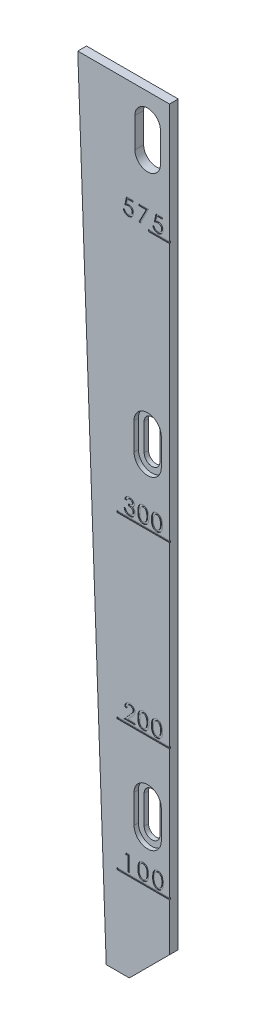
from build123d import *

# Parameters (mm, degrees)
BOSS_EXTRUDE1_DEPTH = 1.27
CUT_EXTRUDE1_DEPTH  = 0.635
SKETCH3_W           = 3.048
SKETCH3_H           = 0.254
SKETCH3_W_2         = 7.62
CUT_EXTRUDE2_DEPTH  = 0.127
CUT_EXTRUDE3_DEPTH  = 0.127


with BuildPart() as part:
    # Sketch1 → Boss-Extrude1 (new body)
    with BuildSketch(Plane.XY):
        Polygon((0, 0), (-13.335, 0), (-9.1948, -112.9284), (-5.842, -112.9284), (0, -107.0864), align=None)
        with BuildLine():
            Line((-1.3208, -3.9624), (-1.3208, -8.2804))
            ThreePointArc((-1.3208, -8.2804), (-3.175, -10.1346), (-5.0292, -8.2804))
            Line((-5.0292, -8.2804), (-5.0292, -3.9624))
            ThreePointArc((-5.0292, -3.9624), (-3.175, -2.1082), (-1.3208, -3.9624))
        make_face(mode=Mode.SUBTRACT)
        with BuildLine():
            Line((-2.032, -42.43233315), (-2.032, -46.3804))
            ThreePointArc((-2.032, -46.3804), (-3.175, -47.5234), (-4.318, -46.3804))
            Line((-4.318, -46.3804), (-4.318, -42.43233315))
            ThreePointArc((-4.318, -42.43233315), (-3.175, -41.28933315), (-2.032, -42.43233315))
        make_face(mode=Mode.SUBTRACT)
        with BuildLine():
            Line((-4.318, -93.3704), (-4.318, -89.2302))
            ThreePointArc((-4.318, -89.2302), (-3.175, -88.0872), (-2.032, -89.2302))
            Line((-2.032, -89.2302), (-2.032, -93.3704))
            ThreePointArc((-2.032, -93.3704), (-3.175, -94.5134), (-4.318, -93.3704))
        make_face(mode=Mode.SUBTRACT)
    extrude(amount=-BOSS_EXTRUDE1_DEPTH)

    # Sketch2 → Cut-Extrude1 (cut)
    with BuildSketch(Plane.XY):
        with BuildLine():
            Line((-1.1938, -42.43233315), (-1.1938, -46.3804))
            ThreePointArc((-1.1938, -46.3804), (-3.175, -48.3616), (-5.1562, -46.3804))
            Line((-5.1562, -46.3804), (-5.1562, -42.43233315))
            ThreePointArc((-5.1562, -42.43233315), (-3.175, -40.45113315), (-1.1938, -42.43233315))
        make_face()
        with BuildLine():
            Line((-5.1562, -93.3704), (-5.1562, -89.2302))
            ThreePointArc((-5.1562, -89.2302), (-3.175, -87.249), (-1.1938, -89.2302))
            Line((-1.1938, -89.2302), (-1.1938, -93.3704))
            ThreePointArc((-1.1938, -93.3704), (-3.175, -95.3516), (-5.1562, -93.3704))
        make_face()
    extrude(amount=-CUT_EXTRUDE1_DEPTH, mode=Mode.SUBTRACT)

    # Sketch3 → Cut-Extrude2 (cut)
    with BuildSketch(Plane.XY):
        with Locations((-1.524, -17.4498)):
            Rectangle(SKETCH3_W, SKETCH3_H)
        with Locations((-3.81, -55.0926)):
            Rectangle(SKETCH3_W_2, SKETCH3_H)
        with Locations((-3.81, -81.0514)):
            Rectangle(SKETCH3_W_2, SKETCH3_H)
        with Locations((-3.81, -100.0506)):
            Rectangle(SKETCH3_W_2, SKETCH3_H)
    extrude(amount=-CUT_EXTRUDE2_DEPTH, mode=Mode.SUBTRACT)

    # Sketch5 → Cut-Extrude3 (cut)
    # profile 1 of 12: a face of its own
    with BuildSketch(Plane.XY):
        with BuildLine():
            add(Edge.make_bspline(
                [(-2.62449771, -53.569515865), (-2.624279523, -53.533182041), (-2.623855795, -53.462620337), (-2.619289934, -53.359971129), (-2.611413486, -53.263619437), (-2.601296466, -53.173562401), (-2.587299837, -53.089738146), (-2.571284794, -53.01210525), (-2.551570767, -52.940654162), (-2.528544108, -52.875257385), (-2.5026898, -52.81475345), (-2.474262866, -52.758384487), (-2.443443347, -52.705434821), (-2.410439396, -52.655922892), (-2.373690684, -52.610951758), (-2.335354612, -52.568981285), (-2.293991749, -52.530830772), (-2.24998115, -52.496691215), (-2.204454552, -52.465825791), (-2.156873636, -52.439810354), (-2.108340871, -52.41714843), (-2.058237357, -52.3988169), (-2.006926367, -52.384576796), (-1.954224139, -52.374632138), (-1.900381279, -52.367783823), (-1.863892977, -52.367251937), (-1.845554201, -52.366984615)],
                knots=[0, 0, 0, 0, 1.622528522, 3.151013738, 4.587225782, 5.939257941, 7.196658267, 8.381214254, 9.47772444, 10.503964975, 11.475138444, 12.414102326, 13.321377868, 14.209997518, 15.068075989, 15.912287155, 16.746865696, 17.577313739, 18.397854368, 19.200328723, 19.996378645, 20.787862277, 21.580050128, 22.371504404, 23.181529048, 24, 24, 24, 24], degree=3))
            add(Edge.make_bspline(
                [(-1.845554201, -52.366984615), (-1.825548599, -52.367511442), (-1.786061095, -52.368551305), (-1.727459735, -52.374210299), (-1.670823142, -52.38564335), (-1.615374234, -52.399980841), (-1.562011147, -52.419580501), (-1.509676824, -52.442119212), (-1.459982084, -52.4706666), (-1.411231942, -52.501893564), (-1.365097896, -52.53790442), (-1.320972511, -52.577032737), (-1.280231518, -52.620614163), (-1.241389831, -52.667149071), (-1.206439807, -52.718459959), (-1.173168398, -52.77275014), (-1.14370869, -52.831371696), (-1.115757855, -52.893287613), (-1.09173245, -52.960144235), (-1.069987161, -53.031559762), (-1.052364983, -53.108423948), (-1.037746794, -53.190497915), (-1.026481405, -53.277919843), (-1.018161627, -53.370482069), (-1.013817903, -53.468271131), (-1.01299643, -53.535167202), (-1.012574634, -53.569515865)],
                knots=[0, 0, 0, 0, 0.875057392, 1.727207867, 2.570264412, 3.399251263, 4.229017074, 5.053828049, 5.887584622, 6.731829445, 7.583639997, 8.443960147, 9.308026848, 10.190032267, 11.091770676, 12.020167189, 12.972467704, 13.958579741, 14.989078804, 16.076606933, 17.221320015, 18.435081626, 19.720875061, 21.074561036, 22.497895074, 24, 24, 24, 24], degree=3))
            add(Edge.make_bspline(
                [(-1.012574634, -53.569515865), (-1.013000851, -53.603711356), (-1.013830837, -53.670301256), (-1.018112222, -53.767640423), (-1.026647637, -53.859699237), (-1.03715696, -53.946736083), (-1.05189797, -54.028486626), (-1.069846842, -54.104994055), (-1.08997505, -54.176660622), (-1.11458081, -54.242858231), (-1.141826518, -54.304701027), (-1.171386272, -54.362798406), (-1.203941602, -54.417264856), (-1.23998868, -54.467509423), (-1.277809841, -54.515113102), (-1.31904817, -54.558421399), (-1.362952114, -54.598259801), (-1.409415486, -54.634120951), (-1.457906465, -54.666460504), (-1.508729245, -54.693758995), (-1.560602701, -54.717989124), (-1.614685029, -54.73635198), (-1.669879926, -54.752023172), (-1.727116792, -54.762145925), (-1.785864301, -54.768848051), (-1.825538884, -54.769756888), (-1.845554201, -54.770215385)],
                knots=[0, 0, 0, 0, 1.496607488, 2.914388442, 4.262485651, 5.541812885, 6.749953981, 7.895567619, 8.980172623, 10.005210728, 10.983286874, 11.936336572, 12.856292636, 13.757107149, 14.640766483, 15.514956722, 16.370989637, 17.232841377, 18.081413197, 18.918442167, 19.755471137, 20.583656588, 21.41504191, 22.264086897, 23.124254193, 24, 24, 24, 24], degree=3))
            add(Edge.make_bspline(
                [(-1.845554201, -54.770215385), (-1.864039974, -54.769901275), (-1.900652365, -54.76927916), (-1.954716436, -54.763177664), (-2.0073826, -54.753051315), (-2.058496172, -54.738858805), (-2.108416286, -54.72083977), (-2.156926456, -54.699012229), (-2.20370784, -54.672581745), (-2.249206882, -54.642884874), (-2.292762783, -54.609106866), (-2.3333321, -54.570929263), (-2.371890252, -54.529264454), (-2.407673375, -54.483663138), (-2.441472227, -54.43441969), (-2.471941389, -54.381070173), (-2.500348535, -54.324184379), (-2.526685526, -54.263324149), (-2.550465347, -54.197432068), (-2.569431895, -54.125219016), (-2.587317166, -54.047472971), (-2.60044238, -53.96340743), (-2.611830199, -53.873656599), (-2.618436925, -53.777637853), (-2.62408288, -53.675669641), (-2.624356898, -53.605549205), (-2.62449771, -53.569515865)],
                knots=[0, 0, 0, 0, 0.82614074, 1.636230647, 2.42850654, 3.22151677, 4.005075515, 4.799112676, 5.596456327, 6.404618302, 7.226350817, 8.05679228, 8.892237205, 9.761873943, 10.645770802, 11.559890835, 12.505927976, 13.487073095, 14.523090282, 15.633895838, 16.822583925, 18.088023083, 19.435493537, 20.865857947, 22.389433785, 24, 24, 24, 24], degree=3))
        make_face()
        with BuildLine():
            add(Edge.make_bspline(
                [(-2.331420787, -53.5686), (-2.331303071, -53.599285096), (-2.33107518, -53.658689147), (-2.327691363, -53.744649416), (-2.32287372, -53.824691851), (-2.315667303, -53.898794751), (-2.306057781, -53.967068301), (-2.29468396, -54.029418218), (-2.281716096, -54.085963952), (-2.265906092, -54.13679842), (-2.248400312, -54.183116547), (-2.228936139, -54.225758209), (-2.208725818, -54.265689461), (-2.185959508, -54.302118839), (-2.161849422, -54.335544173), (-2.135960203, -54.365838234), (-2.109216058, -54.393665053), (-2.071065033, -54.424564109), (-2.022182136, -54.45686904), (-1.961499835, -54.484881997), (-1.900360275, -54.503373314), (-1.859111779, -54.50542844), (-1.83868521, -54.506446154)],
                knots=[0, 0, 0, 0, 1.564601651, 3.028951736, 4.386019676, 5.653114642, 6.824348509, 7.900668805, 8.88431448, 9.780488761, 10.613163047, 11.407444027, 12.169849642, 12.89344098, 13.595615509, 14.26934431, 14.924332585, 15.560171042, 16.769153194, 17.901006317, 18.960562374, 20, 20, 20, 20], degree=3))
            add(Edge.make_bspline(
                [(-1.83868521, -54.506446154), (-1.815537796, -54.505235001), (-1.769387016, -54.502820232), (-1.701418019, -54.485237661), (-1.636246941, -54.455727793), (-1.584608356, -54.422388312), (-1.54559332, -54.389961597), (-1.517417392, -54.362356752), (-1.491447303, -54.331537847), (-1.466930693, -54.297974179), (-1.444762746, -54.261116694), (-1.423387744, -54.221801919), (-1.404776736, -54.17908663), (-1.394020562, -54.149320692), (-1.388537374, -54.134146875)],
                knots=[0, 0, 0, 0, 1.331887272, 2.655486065, 4.012646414, 5.436183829, 6.178803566, 6.930724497, 7.703763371, 8.496530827, 9.320959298, 10.178042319, 11.071218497, 12, 12, 12, 12], degree=3))
            add(Edge.make_bspline(
                [(-1.388537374, -54.134146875), (-1.381931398, -54.114210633), (-1.368464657, -54.073569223), (-1.351592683, -54.010293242), (-1.337624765, -53.943897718), (-1.325597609, -53.874736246), (-1.316465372, -53.802460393), (-1.310153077, -53.727139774), (-1.306532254, -53.648773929), (-1.305948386, -53.595621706), (-1.305651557, -53.5686)],
                knots=[0, 0, 0, 0, 0.877617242, 1.789083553, 2.735016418, 3.71249782, 4.722174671, 5.778575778, 6.870664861, 8, 8, 8, 8], degree=3))
            add(Edge.make_bspline(
                [(-1.305651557, -53.5686), (-1.3057226, -53.541575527), (-1.305861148, -53.48887328), (-1.30997892, -53.411782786), (-1.314958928, -53.338402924), (-1.323550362, -53.268974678), (-1.333165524, -53.203151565), (-1.346354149, -53.141398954), (-1.360499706, -53.083100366), (-1.378171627, -53.028975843), (-1.397492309, -52.978479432), (-1.417870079, -52.93144305), (-1.439903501, -52.88782906), (-1.464179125, -52.848184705), (-1.489801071, -52.811856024), (-1.516864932, -52.779061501), (-1.545773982, -52.749985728), (-1.586189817, -52.717202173), (-1.638290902, -52.683081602), (-1.703438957, -52.652460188), (-1.770710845, -52.634407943), (-1.816145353, -52.631965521), (-1.83868521, -52.630753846)],
                knots=[0, 0, 0, 0, 1.353201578, 2.638969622, 3.865559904, 5.035676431, 6.141732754, 7.195734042, 8.19695873, 9.144657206, 10.044788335, 10.904062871, 11.710933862, 12.489720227, 13.229995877, 13.935715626, 14.616825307, 15.279494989, 16.538995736, 17.725922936, 18.871840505, 20, 20, 20, 20], degree=3))
            add(Edge.make_bspline(
                [(-1.83868521, -52.630753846), (-1.859105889, -52.631791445), (-1.900489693, -52.633894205), (-1.96172204, -52.652128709), (-2.022185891, -52.680363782), (-2.070741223, -52.712691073), (-2.108576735, -52.74355736), (-2.135685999, -52.77075126), (-2.160731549, -52.8012165), (-2.184901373, -52.834372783), (-2.206971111, -52.871041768), (-2.228406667, -52.91055454), (-2.247292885, -52.953563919), (-2.26505428, -52.999917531), (-2.28069776, -53.050844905), (-2.29422611, -53.107304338), (-2.306315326, -53.169585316), (-2.315027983, -53.237996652), (-2.32235214, -53.312212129), (-2.327833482, -53.39238001), (-2.331033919, -53.478513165), (-2.331289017, -53.537915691), (-2.331420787, -53.5686)],
                knots=[0, 0, 0, 0, 1.039778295, 2.107176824, 3.232337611, 4.43520669, 5.071253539, 5.720927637, 6.389866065, 7.081397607, 7.811854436, 8.571243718, 9.372887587, 10.205834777, 11.102302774, 12.088086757, 13.166194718, 14.33675119, 15.604261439, 16.970055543, 18.43488556, 20, 20, 20, 20], degree=3))
        make_face(mode=Mode.SUBTRACT)
    # profile 2 of 12: a face of its own
    with BuildSketch(Plane.XY):
        with BuildLine():
            add(Edge.make_bspline(
                [(-4.60862848, -53.569515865), (-4.608410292, -53.533182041), (-4.607986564, -53.462620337), (-4.603420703, -53.359971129), (-4.595544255, -53.263619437), (-4.585427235, -53.173562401), (-4.571430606, -53.089738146), (-4.555415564, -53.01210525), (-4.535701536, -52.940654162), (-4.512674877, -52.875257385), (-4.486820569, -52.81475345), (-4.458393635, -52.758384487), (-4.427574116, -52.705434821), (-4.394570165, -52.655922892), (-4.357821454, -52.610951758), (-4.319485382, -52.568981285), (-4.278122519, -52.530830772), (-4.234111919, -52.496691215), (-4.188585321, -52.465825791), (-4.141004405, -52.439810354), (-4.09247164, -52.41714843), (-4.042368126, -52.3988169), (-3.991057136, -52.384576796), (-3.938354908, -52.374632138), (-3.884512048, -52.367783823), (-3.848023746, -52.367251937), (-3.82968497, -52.366984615)],
                knots=[0, 0, 0, 0, 1.622528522, 3.151013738, 4.587225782, 5.939257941, 7.196658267, 8.381214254, 9.47772444, 10.503964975, 11.475138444, 12.414102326, 13.321377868, 14.209997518, 15.068075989, 15.912287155, 16.746865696, 17.577313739, 18.397854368, 19.200328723, 19.996378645, 20.787862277, 21.580050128, 22.371504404, 23.181529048, 24, 24, 24, 24], degree=3))
            add(Edge.make_bspline(
                [(-3.82968497, -52.366984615), (-3.809679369, -52.367511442), (-3.770191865, -52.368551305), (-3.711590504, -52.374210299), (-3.654953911, -52.38564335), (-3.599505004, -52.399980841), (-3.546141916, -52.419580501), (-3.493807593, -52.442119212), (-3.444112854, -52.4706666), (-3.395362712, -52.501893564), (-3.349228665, -52.53790442), (-3.305103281, -52.577032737), (-3.264362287, -52.620614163), (-3.2255206, -52.667149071), (-3.190570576, -52.718459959), (-3.157299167, -52.77275014), (-3.127839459, -52.831371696), (-3.099888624, -52.893287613), (-3.075863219, -52.960144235), (-3.05411793, -53.031559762), (-3.036495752, -53.108423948), (-3.021877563, -53.190497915), (-3.010612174, -53.277919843), (-3.002292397, -53.370482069), (-2.997948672, -53.468271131), (-2.997127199, -53.535167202), (-2.996705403, -53.569515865)],
                knots=[0, 0, 0, 0, 0.875057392, 1.727207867, 2.570264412, 3.399251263, 4.229017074, 5.053828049, 5.887584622, 6.731829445, 7.583639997, 8.443960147, 9.308026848, 10.190032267, 11.091770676, 12.020167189, 12.972467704, 13.958579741, 14.989078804, 16.076606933, 17.221320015, 18.435081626, 19.720875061, 21.074561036, 22.497895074, 24, 24, 24, 24], degree=3))
            add(Edge.make_bspline(
                [(-2.996705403, -53.569515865), (-2.99713162, -53.603711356), (-2.997961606, -53.670301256), (-3.002242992, -53.767640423), (-3.010778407, -53.859699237), (-3.021287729, -53.946736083), (-3.03602874, -54.028486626), (-3.053977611, -54.104994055), (-3.07410582, -54.176660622), (-3.09871158, -54.242858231), (-3.125957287, -54.304701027), (-3.155517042, -54.362798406), (-3.188072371, -54.417264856), (-3.22411945, -54.467509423), (-3.26194061, -54.515113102), (-3.303178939, -54.558421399), (-3.347082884, -54.598259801), (-3.393546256, -54.634120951), (-3.442037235, -54.666460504), (-3.492860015, -54.693758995), (-3.54473347, -54.717989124), (-3.598815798, -54.73635198), (-3.654010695, -54.752023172), (-3.711247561, -54.762145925), (-3.76999507, -54.768848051), (-3.809669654, -54.769756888), (-3.82968497, -54.770215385)],
                knots=[0, 0, 0, 0, 1.496607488, 2.914388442, 4.262485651, 5.541812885, 6.749953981, 7.895567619, 8.980172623, 10.005210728, 10.983286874, 11.936336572, 12.856292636, 13.757107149, 14.640766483, 15.514956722, 16.370989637, 17.232841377, 18.081413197, 18.918442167, 19.755471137, 20.583656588, 21.41504191, 22.264086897, 23.124254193, 24, 24, 24, 24], degree=3))
            add(Edge.make_bspline(
                [(-3.82968497, -54.770215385), (-3.848170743, -54.769901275), (-3.884783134, -54.76927916), (-3.938847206, -54.763177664), (-3.991513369, -54.753051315), (-4.042626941, -54.738858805), (-4.092547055, -54.72083977), (-4.141057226, -54.699012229), (-4.187838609, -54.672581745), (-4.233337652, -54.642884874), (-4.276893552, -54.609106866), (-4.317462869, -54.570929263), (-4.356021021, -54.529264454), (-4.391804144, -54.483663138), (-4.425602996, -54.43441969), (-4.456072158, -54.381070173), (-4.484479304, -54.324184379), (-4.510816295, -54.263324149), (-4.534596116, -54.197432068), (-4.553562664, -54.125219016), (-4.571447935, -54.047472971), (-4.584573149, -53.96340743), (-4.595960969, -53.873656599), (-4.602567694, -53.777637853), (-4.608213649, -53.675669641), (-4.608487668, -53.605549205), (-4.60862848, -53.569515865)],
                knots=[0, 0, 0, 0, 0.82614074, 1.636230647, 2.42850654, 3.22151677, 4.005075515, 4.799112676, 5.596456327, 6.404618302, 7.226350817, 8.05679228, 8.892237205, 9.761873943, 10.645770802, 11.559890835, 12.505927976, 13.487073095, 14.523090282, 15.633895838, 16.822583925, 18.088023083, 19.435493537, 20.865857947, 22.389433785, 24, 24, 24, 24], degree=3))
        make_face()
        with BuildLine():
            add(Edge.make_bspline(
                [(-4.315551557, -53.5686), (-4.31543384, -53.599285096), (-4.315205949, -53.658689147), (-4.311822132, -53.744649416), (-4.307004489, -53.824691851), (-4.299798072, -53.898794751), (-4.29018855, -53.967068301), (-4.278814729, -54.029418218), (-4.265846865, -54.085963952), (-4.250036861, -54.13679842), (-4.232531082, -54.183116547), (-4.213066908, -54.225758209), (-4.192856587, -54.265689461), (-4.170090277, -54.302118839), (-4.145980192, -54.335544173), (-4.120090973, -54.365838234), (-4.093346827, -54.393665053), (-4.055195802, -54.424564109), (-4.006312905, -54.45686904), (-3.945630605, -54.484881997), (-3.884491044, -54.503373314), (-3.843242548, -54.50542844), (-3.82281598, -54.506446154)],
                knots=[0, 0, 0, 0, 1.564601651, 3.028951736, 4.386019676, 5.653114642, 6.824348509, 7.900668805, 8.88431448, 9.780488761, 10.613163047, 11.407444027, 12.169849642, 12.89344098, 13.595615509, 14.26934431, 14.924332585, 15.560171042, 16.769153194, 17.901006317, 18.960562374, 20, 20, 20, 20], degree=3))
            add(Edge.make_bspline(
                [(-3.82281598, -54.506446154), (-3.799668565, -54.505235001), (-3.753517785, -54.502820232), (-3.685548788, -54.485237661), (-3.62037771, -54.455727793), (-3.568739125, -54.422388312), (-3.529724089, -54.389961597), (-3.501548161, -54.362356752), (-3.475578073, -54.331537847), (-3.451061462, -54.297974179), (-3.428893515, -54.261116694), (-3.407518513, -54.221801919), (-3.388907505, -54.17908663), (-3.378151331, -54.149320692), (-3.372668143, -54.134146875)],
                knots=[0, 0, 0, 0, 1.331887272, 2.655486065, 4.012646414, 5.436183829, 6.178803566, 6.930724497, 7.703763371, 8.496530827, 9.320959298, 10.178042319, 11.071218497, 12, 12, 12, 12], degree=3))
            add(Edge.make_bspline(
                [(-3.372668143, -54.134146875), (-3.366062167, -54.114210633), (-3.352595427, -54.073569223), (-3.335723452, -54.010293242), (-3.321755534, -53.943897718), (-3.309728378, -53.874736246), (-3.300596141, -53.802460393), (-3.294283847, -53.727139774), (-3.290663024, -53.648773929), (-3.290079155, -53.595621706), (-3.289782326, -53.5686)],
                knots=[0, 0, 0, 0, 0.877617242, 1.789083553, 2.735016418, 3.71249782, 4.722174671, 5.778575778, 6.870664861, 8, 8, 8, 8], degree=3))
            add(Edge.make_bspline(
                [(-3.289782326, -53.5686), (-3.28985337, -53.541575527), (-3.289991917, -53.48887328), (-3.29410969, -53.411782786), (-3.299089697, -53.338402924), (-3.307681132, -53.268974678), (-3.317296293, -53.203151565), (-3.330484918, -53.141398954), (-3.344630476, -53.083100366), (-3.362302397, -53.028975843), (-3.381623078, -52.978479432), (-3.402000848, -52.93144305), (-3.424034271, -52.88782906), (-3.448309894, -52.848184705), (-3.47393184, -52.811856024), (-3.500995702, -52.779061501), (-3.529904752, -52.749985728), (-3.570320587, -52.717202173), (-3.622421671, -52.683081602), (-3.687569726, -52.652460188), (-3.754841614, -52.634407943), (-3.800276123, -52.631965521), (-3.82281598, -52.630753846)],
                knots=[0, 0, 0, 0, 1.353201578, 2.638969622, 3.865559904, 5.035676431, 6.141732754, 7.195734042, 8.19695873, 9.144657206, 10.044788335, 10.904062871, 11.710933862, 12.489720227, 13.229995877, 13.935715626, 14.616825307, 15.279494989, 16.538995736, 17.725922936, 18.871840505, 20, 20, 20, 20], degree=3))
            add(Edge.make_bspline(
                [(-3.82281598, -52.630753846), (-3.843236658, -52.631791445), (-3.884620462, -52.633894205), (-3.945852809, -52.652128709), (-4.00631666, -52.680363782), (-4.054871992, -52.712691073), (-4.092707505, -52.74355736), (-4.119816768, -52.77075126), (-4.144862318, -52.8012165), (-4.169032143, -52.834372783), (-4.19110188, -52.871041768), (-4.212537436, -52.91055454), (-4.231423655, -52.953563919), (-4.249185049, -52.999917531), (-4.26482853, -53.050844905), (-4.278356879, -53.107304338), (-4.290446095, -53.169585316), (-4.299158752, -53.237996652), (-4.306482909, -53.312212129), (-4.311964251, -53.39238001), (-4.315164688, -53.478513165), (-4.315419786, -53.537915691), (-4.315551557, -53.5686)],
                knots=[0, 0, 0, 0, 1.039778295, 2.107176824, 3.232337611, 4.43520669, 5.071253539, 5.720927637, 6.389866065, 7.081397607, 7.811854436, 8.571243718, 9.372887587, 10.205834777, 11.102302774, 12.088086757, 13.166194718, 14.33675119, 15.604261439, 16.970055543, 18.43488556, 20, 20, 20, 20], degree=3))
        make_face(mode=Mode.SUBTRACT)
    # profile 3 of 12: a face of its own
    with BuildSketch(Plane.XY):
        with BuildLine():
            Line((-6.223665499, -52.982446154), (-6.504836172, -52.982446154))
            add(Edge.make_bspline(
                [(-6.504836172, -52.982446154), (-6.499103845, -52.957161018), (-6.487882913, -52.907665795), (-6.465200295, -52.83696005), (-6.439642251, -52.770836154), (-6.410114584, -52.709799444), (-6.375898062, -52.654325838), (-6.338857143, -52.603344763), (-6.297401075, -52.557919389), (-6.252440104, -52.517421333), (-6.204201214, -52.482436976), (-6.154111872, -52.45140213), (-6.101773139, -52.425381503), (-6.047514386, -52.40358013), (-5.991056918, -52.387078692), (-5.932447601, -52.375932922), (-5.872030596, -52.368103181), (-5.830937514, -52.367360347), (-5.810152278, -52.366984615)],
                knots=[0, 0, 0, 0, 1.225194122, 2.398296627, 3.506547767, 4.574817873, 5.598350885, 6.584148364, 7.54966307, 8.500147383, 9.439776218, 10.36307994, 11.282851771, 12.199447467, 13.124300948, 14.058371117, 15.017907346, 16, 16, 16, 16], degree=3))
            add(Edge.make_bspline(
                [(-5.810152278, -52.366984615), (-5.77788283, -52.3680713), (-5.714009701, -52.370222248), (-5.619915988, -52.386475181), (-5.529517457, -52.414373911), (-5.443655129, -52.45208713), (-5.36430948, -52.498263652), (-5.294134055, -52.552134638), (-5.233781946, -52.612361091), (-5.184997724, -52.679014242), (-5.146366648, -52.748955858), (-5.11876515, -52.820756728), (-5.101212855, -52.893683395), (-5.099114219, -52.942815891), (-5.098066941, -52.967334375)],
                knots=[0, 0, 0, 0, 1.126551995, 2.229861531, 3.322496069, 4.422827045, 5.497949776, 6.520418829, 7.504194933, 8.464779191, 9.395175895, 10.286118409, 11.144725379, 12, 12, 12, 12], degree=3))
            add(Edge.make_bspline(
                [(-5.098066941, -52.967334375), (-5.098815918, -52.991051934), (-5.100281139, -53.037450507), (-5.113021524, -53.104900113), (-5.133507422, -53.168174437), (-5.162812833, -53.227010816), (-5.200159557, -53.281527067), (-5.246236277, -53.331252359), (-5.300133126, -53.377092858), (-5.340881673, -53.402858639), (-5.361836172, -53.416108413)],
                knots=[0, 0, 0, 0, 1.039530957, 2.033630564, 2.999111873, 3.948297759, 4.906578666, 5.887513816, 6.913676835, 8, 8, 8, 8], degree=3))
            add(Edge.make_bspline(
                [(-5.361836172, -53.416108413), (-5.339193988, -53.425809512), (-5.294014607, -53.445166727), (-5.232519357, -53.48643438), (-5.175988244, -53.535684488), (-5.144376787, -53.574798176), (-5.128290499, -53.594702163)],
                knots=[0, 0, 0, 0, 0.990740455, 1.976887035, 2.970487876, 4, 4, 4, 4], degree=3))
            add(Edge.make_bspline(
                [(-5.128290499, -53.594702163), (-5.116634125, -53.610890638), (-5.093610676, -53.642865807), (-5.063068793, -53.692807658), (-5.038242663, -53.744307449), (-5.01666951, -53.796065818), (-5.00073788, -53.84905118), (-4.989257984, -53.902800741), (-4.98213998, -53.957499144), (-4.981272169, -53.994303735), (-4.980836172, -54.012794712)],
                knots=[0, 0, 0, 0, 1.060434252, 2.094549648, 3.107169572, 4.097295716, 5.072846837, 6.043796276, 7.017184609, 8, 8, 8, 8], degree=3))
            add(Edge.make_bspline(
                [(-4.980836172, -54.012794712), (-4.981986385, -54.044657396), (-4.984293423, -54.108565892), (-5.005801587, -54.203193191), (-5.038736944, -54.296409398), (-5.07729476, -54.37112026), (-5.113597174, -54.429052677), (-5.144211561, -54.470400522), (-5.177169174, -54.509646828), (-5.213336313, -54.545860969), (-5.251564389, -54.580345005), (-5.293075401, -54.611939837), (-5.337136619, -54.641276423), (-5.383535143, -54.668250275), (-5.432328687, -54.691936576), (-5.482458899, -54.713238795), (-5.53453086, -54.730321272), (-5.587572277, -54.745372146), (-5.642467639, -54.756011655), (-5.698646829, -54.764560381), (-5.756506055, -54.768922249), (-5.795492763, -54.769781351), (-5.815189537, -54.770215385)],
                knots=[0, 0, 0, 0, 1.521749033, 3.052244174, 4.617626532, 6.240122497, 7.060311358, 7.885196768, 8.698339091, 9.508724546, 10.330730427, 11.158549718, 12.000758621, 12.860902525, 13.722748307, 14.593084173, 15.463328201, 16.341708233, 17.227848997, 18.135261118, 19.057900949, 20, 20, 20, 20], degree=3))
            add(Edge.make_bspline(
                [(-5.815189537, -54.770215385), (-5.840089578, -54.769659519), (-5.889096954, -54.768565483), (-5.960951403, -54.760792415), (-6.029749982, -54.747510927), (-6.095272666, -54.728649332), (-6.157946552, -54.704938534), (-6.217154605, -54.675397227), (-6.273382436, -54.640958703), (-6.326349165, -54.601002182), (-6.375335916, -54.555146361), (-6.42027747, -54.503463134), (-6.459970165, -54.445266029), (-6.495849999, -54.381447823), (-6.526936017, -54.311279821), (-6.553751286, -54.235326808), (-6.576492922, -54.153340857), (-6.587230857, -54.096232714), (-6.592759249, -54.066830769)],
                knots=[0, 0, 0, 0, 1.031951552, 2.031050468, 2.99141865, 3.932589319, 4.853771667, 5.764839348, 6.670884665, 7.583203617, 8.509779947, 9.447179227, 10.415909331, 11.424319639, 12.477825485, 13.592421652, 14.760465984, 16, 16, 16, 16], degree=3))
            Line((-6.592759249, -54.066830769), (-6.308383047, -54.066830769))
            add(Edge.make_bspline(
                [(-6.308383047, -54.066830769), (-6.302715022, -54.086256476), (-6.291854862, -54.123476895), (-6.274051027, -54.176634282), (-6.254898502, -54.224402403), (-6.235163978, -54.2674229), (-6.214748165, -54.305522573), (-6.193208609, -54.338639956), (-6.170987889, -54.367084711), (-6.15425836, -54.382686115), (-6.146274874, -54.39013125)],
                knots=[0, 0, 0, 0, 1.326285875, 2.54121601, 3.672658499, 4.697761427, 5.642367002, 6.502616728, 7.285434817, 8, 8, 8, 8], degree=3))
            add(Edge.make_bspline(
                [(-6.146274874, -54.39013125), (-6.134718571, -54.399564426), (-6.11183069, -54.418247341), (-6.074140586, -54.441349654), (-6.035273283, -54.462031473), (-5.993840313, -54.477593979), (-5.951098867, -54.490748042), (-5.906322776, -54.499819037), (-5.859752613, -54.505416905), (-5.828027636, -54.506100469), (-5.811984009, -54.506446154)],
                knots=[0, 0, 0, 0, 0.989076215, 1.958918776, 2.928708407, 3.907140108, 4.891221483, 5.894723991, 6.935341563, 8, 8, 8, 8], degree=3))
            add(Edge.make_bspline(
                [(-5.811984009, -54.506446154), (-5.792124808, -54.505977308), (-5.753216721, -54.505058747), (-5.696486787, -54.498748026), (-5.642695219, -54.487647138), (-5.592078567, -54.472214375), (-5.544301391, -54.452394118), (-5.499864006, -54.42802807), (-5.45823979, -54.399562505), (-5.4204532, -54.366531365), (-5.386597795, -54.330682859), (-5.356407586, -54.293280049), (-5.330609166, -54.254507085), (-5.309941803, -54.213864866), (-5.293657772, -54.171854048), (-5.282383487, -54.128357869), (-5.27515625, -54.083404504), (-5.274331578, -54.052968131), (-5.273913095, -54.037523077)],
                knots=[0, 0, 0, 0, 1.196856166, 2.344877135, 3.434653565, 4.502660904, 5.529498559, 6.546397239, 7.551828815, 8.562675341, 9.564818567, 10.520268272, 11.456705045, 12.365995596, 13.262962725, 14.166698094, 15.069683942, 16, 16, 16, 16], degree=3))
            add(Edge.make_bspline(
                [(-5.273913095, -54.037523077), (-5.274823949, -54.017149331), (-5.276644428, -53.976429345), (-5.290461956, -53.916552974), (-5.3126233, -53.858484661), (-5.343927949, -53.803583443), (-5.38203103, -53.752150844), (-5.42773299, -53.70709929), (-5.479840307, -53.668607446), (-5.528443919, -53.641995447), (-5.572483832, -53.624408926), (-5.610886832, -53.612172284), (-5.654497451, -53.601303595), (-5.703111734, -53.591781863), (-5.756893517, -53.583589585), (-5.81586016, -53.576826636), (-5.880166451, -53.571430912), (-5.924782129, -53.568664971), (-5.947990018, -53.567226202)],
                knots=[0, 0, 0, 0, 1.058801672, 2.116173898, 3.179133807, 4.280986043, 5.392377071, 6.498225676, 7.604871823, 8.752253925, 9.368447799, 10.068883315, 10.846735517, 11.704571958, 12.644304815, 13.675272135, 14.790738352, 16, 16, 16, 16], degree=3))
            Line((-5.947990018, -53.567226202), (-5.947990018, -53.304830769))
            add(Edge.make_bspline(
                [(-5.947990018, -53.304830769), (-5.917737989, -53.304274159), (-5.859663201, -53.303205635), (-5.776287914, -53.293493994), (-5.700408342, -53.277857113), (-5.632392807, -53.255515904), (-5.573064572, -53.227865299), (-5.521600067, -53.198196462), (-5.479570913, -53.164362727), (-5.446463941, -53.12746279), (-5.422128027, -53.08769974), (-5.403679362, -53.046952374), (-5.393461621, -53.003850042), (-5.391921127, -52.974710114), (-5.391143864, -52.960007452)],
                knots=[0, 0, 0, 0, 1.49683591, 2.87347434, 4.147795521, 5.325633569, 6.407353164, 7.383009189, 8.25851615, 9.066624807, 9.823413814, 10.557538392, 11.272200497, 12, 12, 12, 12], degree=3))
            add(Edge.make_bspline(
                [(-5.391143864, -52.960007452), (-5.391477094, -52.949144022), (-5.392133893, -52.927732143), (-5.397963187, -52.896087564), (-5.406994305, -52.865460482), (-5.419910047, -52.835910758), (-5.436828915, -52.807705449), (-5.456828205, -52.780201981), (-5.481000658, -52.754029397), (-5.508284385, -52.729087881), (-5.538145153, -52.705865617), (-5.570452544, -52.685506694), (-5.604877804, -52.668594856), (-5.641423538, -52.654846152), (-5.679835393, -52.643810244), (-5.720445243, -52.63606923), (-5.763027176, -52.631411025), (-5.792128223, -52.630975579), (-5.806946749, -52.630753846)],
                knots=[0, 0, 0, 0, 0.88508993, 1.744517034, 2.61478088, 3.484243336, 4.365825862, 5.291885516, 6.252189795, 7.265246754, 8.303377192, 9.332440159, 10.373327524, 11.425096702, 12.51242353, 13.62794981, 14.792129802, 16, 16, 16, 16], degree=3))
            add(Edge.make_bspline(
                [(-5.806946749, -52.630753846), (-5.828224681, -52.631674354), (-5.86980672, -52.63347324), (-5.930241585, -52.646392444), (-5.986350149, -52.668875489), (-6.030100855, -52.694493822), (-6.062969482, -52.720470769), (-6.08710546, -52.744860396), (-6.110564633, -52.773832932), (-6.134479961, -52.806624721), (-6.157413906, -52.84430602), (-6.180086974, -52.886225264), (-6.202673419, -52.93262463), (-6.216496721, -52.965432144), (-6.223665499, -52.982446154)],
                knots=[0, 0, 0, 0, 1.30644707, 2.553102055, 3.773430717, 5.004978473, 5.652102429, 6.34150733, 7.107309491, 7.939915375, 8.832283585, 9.813897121, 10.866284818, 12, 12, 12, 12], degree=3))
        make_face()
    # profile 4 of 12: a face of its own
    with BuildSketch(Plane.XY):
        with BuildLine():
            add(Edge.make_bspline(
                [(-2.62449771, -79.528315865), (-2.624279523, -79.491982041), (-2.623855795, -79.421420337), (-2.619289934, -79.318771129), (-2.611413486, -79.222419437), (-2.601296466, -79.132362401), (-2.587299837, -79.048538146), (-2.571284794, -78.97090525), (-2.551570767, -78.899454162), (-2.528544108, -78.834057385), (-2.5026898, -78.77355345), (-2.474262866, -78.717184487), (-2.443443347, -78.664234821), (-2.410439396, -78.614722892), (-2.373690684, -78.569751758), (-2.335354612, -78.527781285), (-2.293991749, -78.489630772), (-2.24998115, -78.455491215), (-2.204454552, -78.424625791), (-2.156873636, -78.398610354), (-2.108340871, -78.37594843), (-2.058237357, -78.3576169), (-2.006926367, -78.343376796), (-1.954224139, -78.333432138), (-1.900381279, -78.326583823), (-1.863892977, -78.326051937), (-1.845554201, -78.325784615)],
                knots=[0, 0, 0, 0, 1.622528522, 3.151013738, 4.587225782, 5.939257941, 7.196658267, 8.381214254, 9.47772444, 10.503964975, 11.475138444, 12.414102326, 13.321377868, 14.209997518, 15.068075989, 15.912287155, 16.746865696, 17.577313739, 18.397854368, 19.200328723, 19.996378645, 20.787862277, 21.580050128, 22.371504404, 23.181529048, 24, 24, 24, 24], degree=3))
            add(Edge.make_bspline(
                [(-1.845554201, -78.325784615), (-1.825548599, -78.326311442), (-1.786061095, -78.327351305), (-1.727459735, -78.333010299), (-1.670823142, -78.34444335), (-1.615374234, -78.358780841), (-1.562011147, -78.378380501), (-1.509676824, -78.400919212), (-1.459982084, -78.4294666), (-1.411231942, -78.460693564), (-1.365097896, -78.49670442), (-1.320972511, -78.535832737), (-1.280231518, -78.579414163), (-1.241389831, -78.625949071), (-1.206439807, -78.677259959), (-1.173168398, -78.73155014), (-1.14370869, -78.790171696), (-1.115757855, -78.852087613), (-1.09173245, -78.918944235), (-1.069987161, -78.990359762), (-1.052364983, -79.067223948), (-1.037746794, -79.149297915), (-1.026481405, -79.236719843), (-1.018161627, -79.329282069), (-1.013817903, -79.427071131), (-1.01299643, -79.493967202), (-1.012574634, -79.528315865)],
                knots=[0, 0, 0, 0, 0.875057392, 1.727207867, 2.570264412, 3.399251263, 4.229017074, 5.053828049, 5.887584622, 6.731829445, 7.583639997, 8.443960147, 9.308026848, 10.190032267, 11.091770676, 12.020167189, 12.972467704, 13.958579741, 14.989078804, 16.076606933, 17.221320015, 18.435081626, 19.720875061, 21.074561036, 22.497895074, 24, 24, 24, 24], degree=3))
            add(Edge.make_bspline(
                [(-1.012574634, -79.528315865), (-1.013000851, -79.562511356), (-1.013830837, -79.629101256), (-1.018112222, -79.726440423), (-1.026647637, -79.818499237), (-1.03715696, -79.905536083), (-1.05189797, -79.987286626), (-1.069846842, -80.063794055), (-1.08997505, -80.135460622), (-1.11458081, -80.201658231), (-1.141826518, -80.263501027), (-1.171386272, -80.321598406), (-1.203941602, -80.376064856), (-1.23998868, -80.426309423), (-1.277809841, -80.473913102), (-1.31904817, -80.517221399), (-1.362952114, -80.557059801), (-1.409415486, -80.592920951), (-1.457906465, -80.625260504), (-1.508729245, -80.652558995), (-1.560602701, -80.676789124), (-1.614685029, -80.69515198), (-1.669879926, -80.710823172), (-1.727116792, -80.720945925), (-1.785864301, -80.727648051), (-1.825538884, -80.728556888), (-1.845554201, -80.729015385)],
                knots=[0, 0, 0, 0, 1.496607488, 2.914388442, 4.262485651, 5.541812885, 6.749953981, 7.895567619, 8.980172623, 10.005210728, 10.983286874, 11.936336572, 12.856292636, 13.757107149, 14.640766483, 15.514956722, 16.370989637, 17.232841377, 18.081413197, 18.918442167, 19.755471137, 20.583656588, 21.41504191, 22.264086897, 23.124254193, 24, 24, 24, 24], degree=3))
            add(Edge.make_bspline(
                [(-1.845554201, -80.729015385), (-1.864039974, -80.728701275), (-1.900652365, -80.72807916), (-1.954716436, -80.721977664), (-2.0073826, -80.711851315), (-2.058496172, -80.697658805), (-2.108416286, -80.67963977), (-2.156926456, -80.657812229), (-2.20370784, -80.631381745), (-2.249206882, -80.601684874), (-2.292762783, -80.567906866), (-2.3333321, -80.529729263), (-2.371890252, -80.488064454), (-2.407673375, -80.442463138), (-2.441472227, -80.39321969), (-2.471941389, -80.339870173), (-2.500348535, -80.282984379), (-2.526685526, -80.222124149), (-2.550465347, -80.156232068), (-2.569431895, -80.084019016), (-2.587317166, -80.006272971), (-2.60044238, -79.92220743), (-2.611830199, -79.832456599), (-2.618436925, -79.736437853), (-2.62408288, -79.634469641), (-2.624356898, -79.564349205), (-2.62449771, -79.528315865)],
                knots=[0, 0, 0, 0, 0.82614074, 1.636230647, 2.42850654, 3.22151677, 4.005075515, 4.799112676, 5.596456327, 6.404618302, 7.226350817, 8.05679228, 8.892237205, 9.761873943, 10.645770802, 11.559890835, 12.505927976, 13.487073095, 14.523090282, 15.633895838, 16.822583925, 18.088023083, 19.435493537, 20.865857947, 22.389433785, 24, 24, 24, 24], degree=3))
        make_face()
        with BuildLine():
            add(Edge.make_bspline(
                [(-2.331420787, -79.5274), (-2.331303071, -79.558085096), (-2.33107518, -79.617489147), (-2.327691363, -79.703449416), (-2.32287372, -79.783491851), (-2.315667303, -79.857594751), (-2.306057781, -79.925868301), (-2.29468396, -79.988218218), (-2.281716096, -80.044763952), (-2.265906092, -80.09559842), (-2.248400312, -80.141916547), (-2.228936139, -80.184558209), (-2.208725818, -80.224489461), (-2.185959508, -80.260918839), (-2.161849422, -80.294344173), (-2.135960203, -80.324638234), (-2.109216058, -80.352465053), (-2.071065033, -80.383364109), (-2.022182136, -80.41566904), (-1.961499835, -80.443681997), (-1.900360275, -80.462173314), (-1.859111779, -80.46422844), (-1.83868521, -80.465246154)],
                knots=[0, 0, 0, 0, 1.564601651, 3.028951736, 4.386019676, 5.653114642, 6.824348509, 7.900668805, 8.88431448, 9.780488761, 10.613163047, 11.407444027, 12.169849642, 12.89344098, 13.595615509, 14.26934431, 14.924332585, 15.560171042, 16.769153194, 17.901006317, 18.960562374, 20, 20, 20, 20], degree=3))
            add(Edge.make_bspline(
                [(-1.83868521, -80.465246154), (-1.815537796, -80.464035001), (-1.769387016, -80.461620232), (-1.701418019, -80.444037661), (-1.636246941, -80.414527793), (-1.584608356, -80.381188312), (-1.54559332, -80.348761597), (-1.517417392, -80.321156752), (-1.491447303, -80.290337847), (-1.466930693, -80.256774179), (-1.444762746, -80.219916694), (-1.423387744, -80.180601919), (-1.404776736, -80.13788663), (-1.394020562, -80.108120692), (-1.388537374, -80.092946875)],
                knots=[0, 0, 0, 0, 1.331887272, 2.655486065, 4.012646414, 5.436183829, 6.178803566, 6.930724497, 7.703763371, 8.496530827, 9.320959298, 10.178042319, 11.071218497, 12, 12, 12, 12], degree=3))
            add(Edge.make_bspline(
                [(-1.388537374, -80.092946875), (-1.381931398, -80.073010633), (-1.368464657, -80.032369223), (-1.351592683, -79.969093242), (-1.337624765, -79.902697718), (-1.325597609, -79.833536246), (-1.316465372, -79.761260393), (-1.310153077, -79.685939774), (-1.306532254, -79.607573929), (-1.305948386, -79.554421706), (-1.305651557, -79.5274)],
                knots=[0, 0, 0, 0, 0.877617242, 1.789083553, 2.735016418, 3.71249782, 4.722174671, 5.778575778, 6.870664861, 8, 8, 8, 8], degree=3))
            add(Edge.make_bspline(
                [(-1.305651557, -79.5274), (-1.3057226, -79.500375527), (-1.305861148, -79.44767328), (-1.30997892, -79.370582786), (-1.314958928, -79.297202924), (-1.323550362, -79.227774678), (-1.333165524, -79.161951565), (-1.346354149, -79.100198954), (-1.360499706, -79.041900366), (-1.378171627, -78.987775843), (-1.397492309, -78.937279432), (-1.417870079, -78.89024305), (-1.439903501, -78.84662906), (-1.464179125, -78.806984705), (-1.489801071, -78.770656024), (-1.516864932, -78.737861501), (-1.545773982, -78.708785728), (-1.586189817, -78.676002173), (-1.638290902, -78.641881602), (-1.703438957, -78.611260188), (-1.770710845, -78.593207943), (-1.816145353, -78.590765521), (-1.83868521, -78.589553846)],
                knots=[0, 0, 0, 0, 1.353201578, 2.638969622, 3.865559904, 5.035676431, 6.141732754, 7.195734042, 8.19695873, 9.144657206, 10.044788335, 10.904062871, 11.710933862, 12.489720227, 13.229995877, 13.935715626, 14.616825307, 15.279494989, 16.538995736, 17.725922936, 18.871840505, 20, 20, 20, 20], degree=3))
            add(Edge.make_bspline(
                [(-1.83868521, -78.589553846), (-1.859105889, -78.590591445), (-1.900489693, -78.592694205), (-1.96172204, -78.610928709), (-2.022185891, -78.639163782), (-2.070741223, -78.671491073), (-2.108576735, -78.70235736), (-2.135685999, -78.72955126), (-2.160731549, -78.7600165), (-2.184901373, -78.793172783), (-2.206971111, -78.829841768), (-2.228406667, -78.86935454), (-2.247292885, -78.912363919), (-2.26505428, -78.958717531), (-2.28069776, -79.009644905), (-2.29422611, -79.066104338), (-2.306315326, -79.128385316), (-2.315027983, -79.196796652), (-2.32235214, -79.271012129), (-2.327833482, -79.35118001), (-2.331033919, -79.437313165), (-2.331289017, -79.496715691), (-2.331420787, -79.5274)],
                knots=[0, 0, 0, 0, 1.039778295, 2.107176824, 3.232337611, 4.43520669, 5.071253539, 5.720927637, 6.389866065, 7.081397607, 7.811854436, 8.571243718, 9.372887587, 10.205834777, 11.102302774, 12.088086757, 13.166194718, 14.33675119, 15.604261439, 16.970055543, 18.43488556, 20, 20, 20, 20], degree=3))
        make_face(mode=Mode.SUBTRACT)
    # profile 5 of 12: a face of its own
    with BuildSketch(Plane.XY):
        with BuildLine():
            add(Edge.make_bspline(
                [(-4.60862848, -79.528315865), (-4.608410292, -79.491982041), (-4.607986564, -79.421420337), (-4.603420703, -79.318771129), (-4.595544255, -79.222419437), (-4.585427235, -79.132362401), (-4.571430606, -79.048538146), (-4.555415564, -78.97090525), (-4.535701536, -78.899454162), (-4.512674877, -78.834057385), (-4.486820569, -78.77355345), (-4.458393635, -78.717184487), (-4.427574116, -78.664234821), (-4.394570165, -78.614722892), (-4.357821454, -78.569751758), (-4.319485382, -78.527781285), (-4.278122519, -78.489630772), (-4.234111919, -78.455491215), (-4.188585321, -78.424625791), (-4.141004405, -78.398610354), (-4.09247164, -78.37594843), (-4.042368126, -78.3576169), (-3.991057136, -78.343376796), (-3.938354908, -78.333432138), (-3.884512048, -78.326583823), (-3.848023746, -78.326051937), (-3.82968497, -78.325784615)],
                knots=[0, 0, 0, 0, 1.622528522, 3.151013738, 4.587225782, 5.939257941, 7.196658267, 8.381214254, 9.47772444, 10.503964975, 11.475138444, 12.414102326, 13.321377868, 14.209997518, 15.068075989, 15.912287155, 16.746865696, 17.577313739, 18.397854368, 19.200328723, 19.996378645, 20.787862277, 21.580050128, 22.371504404, 23.181529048, 24, 24, 24, 24], degree=3))
            add(Edge.make_bspline(
                [(-3.82968497, -78.325784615), (-3.809679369, -78.326311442), (-3.770191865, -78.327351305), (-3.711590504, -78.333010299), (-3.654953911, -78.34444335), (-3.599505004, -78.358780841), (-3.546141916, -78.378380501), (-3.493807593, -78.400919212), (-3.444112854, -78.4294666), (-3.395362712, -78.460693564), (-3.349228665, -78.49670442), (-3.305103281, -78.535832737), (-3.264362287, -78.579414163), (-3.2255206, -78.625949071), (-3.190570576, -78.677259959), (-3.157299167, -78.73155014), (-3.127839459, -78.790171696), (-3.099888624, -78.852087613), (-3.075863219, -78.918944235), (-3.05411793, -78.990359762), (-3.036495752, -79.067223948), (-3.021877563, -79.149297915), (-3.010612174, -79.236719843), (-3.002292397, -79.329282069), (-2.997948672, -79.427071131), (-2.997127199, -79.493967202), (-2.996705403, -79.528315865)],
                knots=[0, 0, 0, 0, 0.875057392, 1.727207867, 2.570264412, 3.399251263, 4.229017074, 5.053828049, 5.887584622, 6.731829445, 7.583639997, 8.443960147, 9.308026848, 10.190032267, 11.091770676, 12.020167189, 12.972467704, 13.958579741, 14.989078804, 16.076606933, 17.221320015, 18.435081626, 19.720875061, 21.074561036, 22.497895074, 24, 24, 24, 24], degree=3))
            add(Edge.make_bspline(
                [(-2.996705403, -79.528315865), (-2.99713162, -79.562511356), (-2.997961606, -79.629101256), (-3.002242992, -79.726440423), (-3.010778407, -79.818499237), (-3.021287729, -79.905536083), (-3.03602874, -79.987286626), (-3.053977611, -80.063794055), (-3.07410582, -80.135460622), (-3.09871158, -80.201658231), (-3.125957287, -80.263501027), (-3.155517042, -80.321598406), (-3.188072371, -80.376064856), (-3.22411945, -80.426309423), (-3.26194061, -80.473913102), (-3.303178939, -80.517221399), (-3.347082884, -80.557059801), (-3.393546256, -80.592920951), (-3.442037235, -80.625260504), (-3.492860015, -80.652558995), (-3.54473347, -80.676789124), (-3.598815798, -80.69515198), (-3.654010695, -80.710823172), (-3.711247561, -80.720945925), (-3.76999507, -80.727648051), (-3.809669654, -80.728556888), (-3.82968497, -80.729015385)],
                knots=[0, 0, 0, 0, 1.496607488, 2.914388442, 4.262485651, 5.541812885, 6.749953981, 7.895567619, 8.980172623, 10.005210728, 10.983286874, 11.936336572, 12.856292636, 13.757107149, 14.640766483, 15.514956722, 16.370989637, 17.232841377, 18.081413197, 18.918442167, 19.755471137, 20.583656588, 21.41504191, 22.264086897, 23.124254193, 24, 24, 24, 24], degree=3))
            add(Edge.make_bspline(
                [(-3.82968497, -80.729015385), (-3.848170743, -80.728701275), (-3.884783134, -80.72807916), (-3.938847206, -80.721977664), (-3.991513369, -80.711851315), (-4.042626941, -80.697658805), (-4.092547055, -80.67963977), (-4.141057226, -80.657812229), (-4.187838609, -80.631381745), (-4.233337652, -80.601684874), (-4.276893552, -80.567906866), (-4.317462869, -80.529729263), (-4.356021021, -80.488064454), (-4.391804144, -80.442463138), (-4.425602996, -80.39321969), (-4.456072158, -80.339870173), (-4.484479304, -80.282984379), (-4.510816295, -80.222124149), (-4.534596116, -80.156232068), (-4.553562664, -80.084019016), (-4.571447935, -80.006272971), (-4.584573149, -79.92220743), (-4.595960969, -79.832456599), (-4.602567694, -79.736437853), (-4.608213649, -79.634469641), (-4.608487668, -79.564349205), (-4.60862848, -79.528315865)],
                knots=[0, 0, 0, 0, 0.82614074, 1.636230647, 2.42850654, 3.22151677, 4.005075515, 4.799112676, 5.596456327, 6.404618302, 7.226350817, 8.05679228, 8.892237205, 9.761873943, 10.645770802, 11.559890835, 12.505927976, 13.487073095, 14.523090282, 15.633895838, 16.822583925, 18.088023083, 19.435493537, 20.865857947, 22.389433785, 24, 24, 24, 24], degree=3))
        make_face()
        with BuildLine():
            add(Edge.make_bspline(
                [(-4.315551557, -79.5274), (-4.31543384, -79.558085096), (-4.315205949, -79.617489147), (-4.311822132, -79.703449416), (-4.307004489, -79.783491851), (-4.299798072, -79.857594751), (-4.29018855, -79.925868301), (-4.278814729, -79.988218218), (-4.265846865, -80.044763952), (-4.250036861, -80.09559842), (-4.232531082, -80.141916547), (-4.213066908, -80.184558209), (-4.192856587, -80.224489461), (-4.170090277, -80.260918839), (-4.145980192, -80.294344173), (-4.120090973, -80.324638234), (-4.093346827, -80.352465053), (-4.055195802, -80.383364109), (-4.006312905, -80.41566904), (-3.945630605, -80.443681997), (-3.884491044, -80.462173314), (-3.843242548, -80.46422844), (-3.82281598, -80.465246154)],
                knots=[0, 0, 0, 0, 1.564601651, 3.028951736, 4.386019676, 5.653114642, 6.824348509, 7.900668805, 8.88431448, 9.780488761, 10.613163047, 11.407444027, 12.169849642, 12.89344098, 13.595615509, 14.26934431, 14.924332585, 15.560171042, 16.769153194, 17.901006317, 18.960562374, 20, 20, 20, 20], degree=3))
            add(Edge.make_bspline(
                [(-3.82281598, -80.465246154), (-3.799668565, -80.464035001), (-3.753517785, -80.461620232), (-3.685548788, -80.444037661), (-3.62037771, -80.414527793), (-3.568739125, -80.381188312), (-3.529724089, -80.348761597), (-3.501548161, -80.321156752), (-3.475578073, -80.290337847), (-3.451061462, -80.256774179), (-3.428893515, -80.219916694), (-3.407518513, -80.180601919), (-3.388907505, -80.13788663), (-3.378151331, -80.108120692), (-3.372668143, -80.092946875)],
                knots=[0, 0, 0, 0, 1.331887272, 2.655486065, 4.012646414, 5.436183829, 6.178803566, 6.930724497, 7.703763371, 8.496530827, 9.320959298, 10.178042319, 11.071218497, 12, 12, 12, 12], degree=3))
            add(Edge.make_bspline(
                [(-3.372668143, -80.092946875), (-3.366062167, -80.073010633), (-3.352595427, -80.032369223), (-3.335723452, -79.969093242), (-3.321755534, -79.902697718), (-3.309728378, -79.833536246), (-3.300596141, -79.761260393), (-3.294283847, -79.685939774), (-3.290663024, -79.607573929), (-3.290079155, -79.554421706), (-3.289782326, -79.5274)],
                knots=[0, 0, 0, 0, 0.877617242, 1.789083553, 2.735016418, 3.71249782, 4.722174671, 5.778575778, 6.870664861, 8, 8, 8, 8], degree=3))
            add(Edge.make_bspline(
                [(-3.289782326, -79.5274), (-3.28985337, -79.500375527), (-3.289991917, -79.44767328), (-3.29410969, -79.370582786), (-3.299089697, -79.297202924), (-3.307681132, -79.227774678), (-3.317296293, -79.161951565), (-3.330484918, -79.100198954), (-3.344630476, -79.041900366), (-3.362302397, -78.987775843), (-3.381623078, -78.937279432), (-3.402000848, -78.89024305), (-3.424034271, -78.84662906), (-3.448309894, -78.806984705), (-3.47393184, -78.770656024), (-3.500995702, -78.737861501), (-3.529904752, -78.708785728), (-3.570320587, -78.676002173), (-3.622421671, -78.641881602), (-3.687569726, -78.611260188), (-3.754841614, -78.593207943), (-3.800276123, -78.590765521), (-3.82281598, -78.589553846)],
                knots=[0, 0, 0, 0, 1.353201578, 2.638969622, 3.865559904, 5.035676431, 6.141732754, 7.195734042, 8.19695873, 9.144657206, 10.044788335, 10.904062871, 11.710933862, 12.489720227, 13.229995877, 13.935715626, 14.616825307, 15.279494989, 16.538995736, 17.725922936, 18.871840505, 20, 20, 20, 20], degree=3))
            add(Edge.make_bspline(
                [(-3.82281598, -78.589553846), (-3.843236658, -78.590591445), (-3.884620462, -78.592694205), (-3.945852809, -78.610928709), (-4.00631666, -78.639163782), (-4.054871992, -78.671491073), (-4.092707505, -78.70235736), (-4.119816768, -78.72955126), (-4.144862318, -78.7600165), (-4.169032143, -78.793172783), (-4.19110188, -78.829841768), (-4.212537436, -78.86935454), (-4.231423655, -78.912363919), (-4.249185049, -78.958717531), (-4.26482853, -79.009644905), (-4.278356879, -79.066104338), (-4.290446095, -79.128385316), (-4.299158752, -79.196796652), (-4.306482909, -79.271012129), (-4.311964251, -79.35118001), (-4.315164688, -79.437313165), (-4.315419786, -79.496715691), (-4.315551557, -79.5274)],
                knots=[0, 0, 0, 0, 1.039778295, 2.107176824, 3.232337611, 4.43520669, 5.071253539, 5.720927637, 6.389866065, 7.081397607, 7.811854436, 8.571243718, 9.372887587, 10.205834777, 11.102302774, 12.088086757, 13.166194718, 14.33675119, 15.604261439, 16.970055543, 18.43488556, 20, 20, 20, 20], degree=3))
        make_face(mode=Mode.SUBTRACT)
    # profile 6 of 12: a face of its own
    with BuildSketch(Plane.XY):
        with BuildLine():
            Line((-6.214964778, -79.117092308), (-6.504836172, -79.117092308))
            add(Edge.make_bspline(
                [(-6.504836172, -79.117092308), (-6.503474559, -79.087596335), (-6.50081143, -79.029906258), (-6.488985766, -78.945845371), (-6.469829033, -78.866638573), (-6.445649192, -78.791614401), (-6.413393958, -78.721710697), (-6.37617787, -78.65570886), (-6.3312495, -78.59499216), (-6.280477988, -78.539464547), (-6.225363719, -78.48901555), (-6.166115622, -78.445514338), (-6.103735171, -78.408444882), (-6.038210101, -78.37819596), (-5.969412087, -78.354774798), (-5.897537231, -78.337731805), (-5.822356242, -78.327480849), (-5.771107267, -78.326355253), (-5.745125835, -78.325784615)],
                knots=[0, 0, 0, 0, 1.154964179, 2.258951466, 3.315045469, 4.34063582, 5.337653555, 6.322213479, 7.300594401, 8.285733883, 9.262436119, 10.219305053, 11.156568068, 12.097250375, 13.037875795, 13.995471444, 14.983774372, 16, 16, 16, 16], degree=3))
            add(Edge.make_bspline(
                [(-5.745125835, -78.325784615), (-5.717923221, -78.326341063), (-5.664544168, -78.327432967), (-5.586811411, -78.337707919), (-5.513244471, -78.354276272), (-5.443821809, -78.376902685), (-5.378669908, -78.407114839), (-5.317660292, -78.443547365), (-5.261379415, -78.487337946), (-5.209418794, -78.536336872), (-5.16352413, -78.590236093), (-5.122071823, -78.645650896), (-5.087807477, -78.703705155), (-5.059102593, -78.763338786), (-5.037013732, -78.825041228), (-5.021414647, -78.888561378), (-5.012064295, -78.953942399), (-5.010788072, -78.998152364), (-5.010143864, -79.02046851)],
                knots=[0, 0, 0, 0, 1.156722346, 2.269809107, 3.328396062, 4.361258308, 5.3694338, 6.377253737, 7.377324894, 8.397019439, 9.4098266, 10.385180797, 11.337325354, 12.27255833, 13.196816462, 14.119704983, 15.050871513, 16, 16, 16, 16], degree=3))
            add(Edge.make_bspline(
                [(-5.010143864, -79.02046851), (-5.011316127, -79.051685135), (-5.013644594, -79.113690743), (-5.031574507, -79.205424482), (-5.061716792, -79.294203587), (-5.096534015, -79.366493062), (-5.131747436, -79.424925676), (-5.164062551, -79.47315655), (-5.202024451, -79.525308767), (-5.246447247, -79.581033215), (-5.295564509, -79.641604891), (-5.351327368, -79.705461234), (-5.412009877, -79.773895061), (-5.455287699, -79.819975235), (-5.477693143, -79.84383149)],
                knots=[0, 0, 0, 0, 1.155755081, 2.295677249, 3.447123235, 4.6205014, 5.259503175, 5.973005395, 6.77029923, 7.648035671, 8.612336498, 9.658570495, 10.787814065, 12, 12, 12, 12], degree=3))
            Line((-5.477693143, -79.84383149), (-6.040034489, -80.406630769))
            Line((-6.040034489, -80.406630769), (-4.980836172, -80.406630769))
            Line((-4.980836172, -80.406630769), (-4.980836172, -80.6704))
            Line((-4.980836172, -80.6704), (-6.592759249, -80.6704))
            Line((-6.592759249, -80.6704), (-5.718107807, -79.704619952))
            add(Edge.make_bspline(
                [(-5.718107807, -79.704619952), (-5.697274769, -79.68240175), (-5.657295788, -79.639764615), (-5.600951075, -79.577350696), (-5.55011553, -79.519650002), (-5.504518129, -79.466704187), (-5.465352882, -79.417801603), (-5.431566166, -79.373661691), (-5.403540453, -79.334076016), (-5.374435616, -79.287480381), (-5.345595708, -79.231624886), (-5.321062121, -79.163489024), (-5.306340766, -79.09390753), (-5.304261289, -79.047096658), (-5.303220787, -79.023674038)],
                knots=[0, 0, 0, 0, 1.341560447, 2.574479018, 3.703506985, 4.728875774, 5.651874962, 6.462761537, 7.177175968, 7.787249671, 8.88179658, 9.938774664, 10.968630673, 12, 12, 12, 12], degree=3))
            add(Edge.make_bspline(
                [(-5.303220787, -79.023674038), (-5.303477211, -79.009143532), (-5.303984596, -78.980391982), (-5.310901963, -78.938288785), (-5.320646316, -78.897451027), (-5.335717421, -78.858535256), (-5.353875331, -78.820775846), (-5.376587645, -78.78466092), (-5.403861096, -78.750525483), (-5.434200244, -78.717601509), (-5.467756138, -78.68787489), (-5.503199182, -78.66121446), (-5.540965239, -78.639562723), (-5.580021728, -78.6206279), (-5.621582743, -78.60720435), (-5.664626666, -78.597209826), (-5.709491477, -78.590286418), (-5.7400619, -78.589801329), (-5.755658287, -78.589553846)],
                knots=[0, 0, 0, 0, 0.999432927, 1.977580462, 2.931018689, 3.885672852, 4.844657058, 5.812871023, 6.815890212, 7.849665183, 8.891901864, 9.898878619, 10.897592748, 11.885014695, 12.882178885, 13.896915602, 14.927050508, 16, 16, 16, 16], degree=3))
            add(Edge.make_bspline(
                [(-5.755658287, -78.589553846), (-5.770485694, -78.589857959), (-5.799655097, -78.590456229), (-5.842614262, -78.596628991), (-5.883849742, -78.60667946), (-5.923500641, -78.620620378), (-5.961854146, -78.637819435), (-5.997972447, -78.66010078), (-6.032445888, -78.68602085), (-6.065730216, -78.715112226), (-6.096022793, -78.749242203), (-6.123117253, -78.788006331), (-6.147042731, -78.83144685), (-6.167493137, -78.879487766), (-6.184441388, -78.932255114), (-6.198037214, -78.989684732), (-6.208548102, -79.051801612), (-6.212786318, -79.094926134), (-6.214964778, -79.117092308)],
                knots=[0, 0, 0, 0, 0.911540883, 1.79324023, 2.663162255, 3.518366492, 4.375475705, 5.243419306, 6.122264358, 7.02676621, 7.957780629, 8.921596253, 9.930241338, 11.002848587, 12.128200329, 13.335197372, 14.630280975, 16, 16, 16, 16], degree=3))
        make_face()
    # profile 7 of 12: a face of its own
    with BuildSketch(Plane.XY):
        with BuildLine():
            add(Edge.make_bspline(
                [(-2.448651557, -98.527515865), (-2.448437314, -98.490876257), (-2.448021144, -98.41970329), (-2.443391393, -98.315994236), (-2.435700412, -98.218701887), (-2.425160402, -98.127821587), (-2.412333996, -98.043329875), (-2.395211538, -97.965452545), (-2.375739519, -97.893829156), (-2.353171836, -97.828226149), (-2.32770724, -97.767759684), (-2.299991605, -97.711311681), (-2.268925, -97.65896755), (-2.236282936, -97.609891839), (-2.20074408, -97.564887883), (-2.163319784, -97.523320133), (-2.122549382, -97.486149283), (-2.079818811, -97.452286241), (-2.034741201, -97.422601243), (-1.988601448, -97.396454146), (-1.94108197, -97.374116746), (-1.892053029, -97.35655345), (-1.841955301, -97.342046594), (-1.790613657, -97.332126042), (-1.737943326, -97.325884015), (-1.702391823, -97.32528726), (-1.684361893, -97.324984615)],
                knots=[0, 0, 0, 0, 1.646270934, 3.197905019, 4.663502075, 6.030701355, 7.308322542, 8.50163776, 9.611534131, 10.641858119, 11.616356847, 12.558055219, 13.465016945, 14.349605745, 15.204443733, 16.039544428, 16.859896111, 17.680448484, 18.487036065, 19.28249412, 20.06191084, 20.843045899, 21.620316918, 22.403196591, 23.190181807, 24, 24, 24, 24], degree=3))
            add(Edge.make_bspline(
                [(-1.684361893, -97.324984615), (-1.666181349, -97.325303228), (-1.630025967, -97.325936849), (-1.576572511, -97.332026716), (-1.524353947, -97.342131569), (-1.4735929, -97.356449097), (-1.423872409, -97.374211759), (-1.375581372, -97.396475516), (-1.328419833, -97.422391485), (-1.283137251, -97.452843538), (-1.239236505, -97.48679539), (-1.197795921, -97.525175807), (-1.158811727, -97.567597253), (-1.121794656, -97.613605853), (-1.087794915, -97.664084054), (-1.055416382, -97.718153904), (-1.026435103, -97.776760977), (-0.998523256, -97.83892742), (-0.974430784, -97.906373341), (-0.952703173, -97.978718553), (-0.935147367, -98.056817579), (-0.920523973, -98.140260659), (-0.909195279, -98.229354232), (-0.900944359, -98.323907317), (-0.896585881, -98.423982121), (-0.895765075, -98.492403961), (-0.895343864, -98.527515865)],
                knots=[0, 0, 0, 0, 0.810914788, 1.612654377, 2.396697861, 3.181598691, 3.963628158, 4.749916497, 5.551656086, 6.361998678, 7.18212741, 8.025565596, 8.878627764, 9.750805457, 10.657531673, 11.591944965, 12.560506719, 13.57287815, 14.630710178, 15.753379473, 16.941251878, 18.199788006, 19.531962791, 20.947069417, 22.433333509, 24, 24, 24, 24], degree=3))
            add(Edge.make_bspline(
                [(-0.895343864, -98.527515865), (-0.895769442, -98.562474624), (-0.896598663, -98.630590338), (-0.900895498, -98.730214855), (-0.909359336, -98.824266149), (-0.919946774, -98.912969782), (-0.93461046, -98.995956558), (-0.952640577, -99.073513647), (-0.972659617, -99.145975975), (-0.997371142, -99.212749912), (-1.024418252, -99.274766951), (-1.053845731, -99.332679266), (-1.085372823, -99.386998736), (-1.119720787, -99.43729057), (-1.156331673, -99.48391103), (-1.195989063, -99.526037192), (-1.237575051, -99.564684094), (-1.281604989, -99.599073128), (-1.327593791, -99.629173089), (-1.374593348, -99.656091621), (-1.42343758, -99.677797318), (-1.473019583, -99.696434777), (-1.524048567, -99.710673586), (-1.576460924, -99.720518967), (-1.629990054, -99.727423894), (-1.666175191, -99.727950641), (-1.684361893, -99.728215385)],
                knots=[0, 0, 0, 0, 1.561518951, 3.042555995, 4.452378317, 5.7783523, 7.031515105, 8.214008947, 9.334062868, 10.386615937, 11.391082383, 12.354592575, 13.286541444, 14.194233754, 15.072674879, 15.931287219, 16.775624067, 17.606195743, 18.42308326, 19.229000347, 20.022332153, 20.807536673, 21.593273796, 22.3848459, 23.188221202, 24, 24, 24, 24], degree=3))
            add(Edge.make_bspline(
                [(-1.684361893, -99.728215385), (-1.702391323, -99.727910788), (-1.73794184, -99.727310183), (-1.790619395, -99.721096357), (-1.841749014, -99.711106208), (-1.891583, -99.697118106), (-1.940377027, -99.679996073), (-1.987466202, -99.657688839), (-2.0333741, -99.631998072), (-2.077978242, -99.602740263), (-2.120440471, -99.569219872), (-2.160999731, -99.532144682), (-2.198637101, -99.490589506), (-2.233667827, -99.445210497), (-2.266961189, -99.396425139), (-2.297586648, -99.34356735), (-2.325914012, -99.286846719), (-2.351806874, -99.225896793), (-2.374763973, -99.159828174), (-2.395042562, -99.087885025), (-2.411053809, -99.009432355), (-2.424758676, -98.925100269), (-2.435812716, -98.834526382), (-2.443359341, -98.737661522), (-2.44802364, -98.634566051), (-2.448438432, -98.563850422), (-2.448651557, -98.527515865)],
                knots=[0, 0, 0, 0, 0.810891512, 1.598919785, 2.382837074, 3.152667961, 3.926044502, 4.706494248, 5.493654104, 6.291793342, 7.103789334, 7.925228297, 8.761435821, 9.622817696, 10.50288917, 11.416980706, 12.369136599, 13.353924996, 14.394355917, 15.514179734, 16.714354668, 17.994756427, 19.357759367, 20.818452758, 22.365282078, 24, 24, 24, 24], degree=3))
        make_face()
        with BuildLine():
            add(Edge.make_bspline(
                [(-2.24349771, -98.5266), (-2.243419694, -98.557133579), (-2.243268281, -98.616393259), (-2.239312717, -98.702505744), (-2.233924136, -98.782822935), (-2.226973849, -98.857446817), (-2.216652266, -98.926124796), (-2.205087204, -98.989329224), (-2.191013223, -99.046725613), (-2.174361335, -99.098707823), (-2.155394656, -99.146158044), (-2.134686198, -99.190311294), (-2.11243968, -99.231689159), (-2.087542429, -99.269919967), (-2.060427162, -99.305128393), (-2.031706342, -99.337937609), (-2.000308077, -99.367196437), (-1.956871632, -99.402287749), (-1.899527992, -99.438549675), (-1.827277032, -99.470126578), (-1.753035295, -99.489970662), (-1.702644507, -99.492494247), (-1.677492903, -99.493753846)],
                knots=[0, 0, 0, 0, 1.459021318, 2.831673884, 4.118529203, 5.306027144, 6.411944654, 7.436330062, 8.375795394, 9.233974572, 10.042671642, 10.816086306, 11.563610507, 12.285937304, 12.993564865, 13.685989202, 14.367179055, 15.041617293, 16.353048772, 17.594441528, 18.799311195, 20, 20, 20, 20], degree=3))
            add(Edge.make_bspline(
                [(-1.677492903, -99.493753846), (-1.652178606, -99.492710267), (-1.601602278, -99.490625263), (-1.527709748, -99.470509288), (-1.455974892, -99.44015804), (-1.399757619, -99.40426947), (-1.356988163, -99.370091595), (-1.326344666, -99.340951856), (-1.298218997, -99.308323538), (-1.271543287, -99.273119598), (-1.247077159, -99.234667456), (-1.224829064, -99.193152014), (-1.204527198, -99.148457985), (-1.192960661, -99.117257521), (-1.187046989, -99.101305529)],
                knots=[0, 0, 0, 0, 1.353760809, 2.704726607, 4.075137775, 5.516104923, 6.260822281, 7.007110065, 7.778089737, 8.566572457, 9.372053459, 10.217411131, 11.088608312, 12, 12, 12, 12], degree=3))
            add(Edge.make_bspline(
                [(-1.187046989, -99.101305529), (-1.180155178, -99.080908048), (-1.166161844, -99.039492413), (-1.148127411, -98.975246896), (-1.133924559, -98.907840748), (-1.121146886, -98.8376768), (-1.112425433, -98.764237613), (-1.105405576, -98.687750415), (-1.101270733, -98.608157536), (-1.100758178, -98.554080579), (-1.10049771, -98.5266)],
                knots=[0, 0, 0, 0, 0.884706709, 1.796334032, 2.740027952, 3.714592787, 4.726048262, 5.777819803, 6.87074269, 8, 8, 8, 8], degree=3))
            add(Edge.make_bspline(
                [(-1.10049771, -98.5266), (-1.100857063, -98.499123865), (-1.101560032, -98.445374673), (-1.104247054, -98.366659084), (-1.111185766, -98.291895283), (-1.118892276, -98.220761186), (-1.130255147, -98.15365056), (-1.142506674, -98.090001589), (-1.158966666, -98.030602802), (-1.176549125, -97.97452423), (-1.196672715, -97.922403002), (-1.218824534, -97.873996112), (-1.242482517, -97.82906986), (-1.26817862, -97.787747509), (-1.295607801, -97.749843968), (-1.325494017, -97.716119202), (-1.356651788, -97.685527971), (-1.400292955, -97.650609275), (-1.457426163, -97.615005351), (-1.52851792, -97.582239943), (-1.602499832, -97.563424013), (-1.652513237, -97.560771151), (-1.677492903, -97.559446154)],
                knots=[0, 0, 0, 0, 1.31362396, 2.569729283, 3.763502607, 4.902122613, 5.988968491, 7.01645872, 7.998833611, 8.933434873, 9.825090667, 10.667526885, 11.477055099, 12.250526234, 12.991942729, 13.710640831, 14.402115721, 15.076753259, 16.378508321, 17.609869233, 18.806226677, 20, 20, 20, 20], degree=3))
            add(Edge.make_bspline(
                [(-1.677492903, -97.559446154), (-1.702776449, -97.560772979), (-1.753389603, -97.563429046), (-1.828140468, -97.582169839), (-1.899793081, -97.614835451), (-1.956775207, -97.6507272), (-2.000446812, -97.684911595), (-2.031198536, -97.714555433), (-2.060032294, -97.746981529), (-2.086594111, -97.782513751), (-2.111471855, -97.820699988), (-2.134319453, -97.86184065), (-2.154904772, -97.906144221), (-2.173901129, -97.953573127), (-2.190603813, -98.005550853), (-2.204381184, -98.062876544), (-2.217109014, -98.12587994), (-2.226119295, -98.194929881), (-2.23412928, -98.269572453), (-2.239276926, -98.350090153), (-2.243281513, -98.43634706), (-2.243424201, -98.495913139), (-2.24349771, -98.5266)],
                knots=[0, 0, 0, 0, 1.207732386, 2.417664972, 3.655092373, 4.956220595, 5.625982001, 6.301752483, 6.994047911, 7.697131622, 8.419323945, 9.170223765, 9.943494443, 10.752040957, 11.610060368, 12.549350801, 13.567764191, 14.679664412, 15.874934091, 17.154273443, 18.533957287, 20, 20, 20, 20], degree=3))
        make_face(mode=Mode.SUBTRACT)
    # profile 8 of 12: a face of its own
    with BuildSketch(Plane.XY):
        with BuildLine():
            add(Edge.make_bspline(
                [(-4.593974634, -98.527515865), (-4.593760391, -98.490876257), (-4.593344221, -98.41970329), (-4.58871447, -98.315994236), (-4.581023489, -98.218701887), (-4.570483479, -98.127821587), (-4.557657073, -98.043329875), (-4.540534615, -97.965452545), (-4.521062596, -97.893829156), (-4.498494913, -97.828226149), (-4.473030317, -97.767759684), (-4.445314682, -97.711311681), (-4.414248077, -97.65896755), (-4.381606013, -97.609891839), (-4.346067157, -97.564887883), (-4.308642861, -97.523320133), (-4.267872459, -97.486149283), (-4.225141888, -97.452286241), (-4.180064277, -97.422601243), (-4.133924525, -97.396454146), (-4.086405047, -97.374116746), (-4.037376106, -97.35655345), (-3.987278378, -97.342046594), (-3.935936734, -97.332126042), (-3.883266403, -97.325884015), (-3.8477149, -97.32528726), (-3.82968497, -97.324984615)],
                knots=[0, 0, 0, 0, 1.646270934, 3.197905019, 4.663502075, 6.030701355, 7.308322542, 8.50163776, 9.611534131, 10.641858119, 11.616356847, 12.558055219, 13.465016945, 14.349605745, 15.204443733, 16.039544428, 16.859896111, 17.680448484, 18.487036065, 19.28249412, 20.06191084, 20.843045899, 21.620316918, 22.403196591, 23.190181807, 24, 24, 24, 24], degree=3))
            add(Edge.make_bspline(
                [(-3.82968497, -97.324984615), (-3.811504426, -97.325303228), (-3.775349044, -97.325936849), (-3.721895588, -97.332026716), (-3.669677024, -97.342131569), (-3.618915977, -97.356449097), (-3.569195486, -97.374211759), (-3.520904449, -97.396475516), (-3.47374291, -97.422391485), (-3.428460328, -97.452843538), (-3.384559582, -97.48679539), (-3.343118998, -97.525175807), (-3.304134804, -97.567597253), (-3.267117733, -97.613605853), (-3.233117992, -97.664084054), (-3.200739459, -97.718153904), (-3.17175818, -97.776760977), (-3.143846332, -97.83892742), (-3.119753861, -97.906373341), (-3.09802625, -97.978718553), (-3.080470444, -98.056817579), (-3.06584705, -98.140260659), (-3.054518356, -98.229354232), (-3.046267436, -98.323907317), (-3.041908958, -98.423982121), (-3.041088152, -98.492403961), (-3.040666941, -98.527515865)],
                knots=[0, 0, 0, 0, 0.810914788, 1.612654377, 2.396697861, 3.181598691, 3.963628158, 4.749916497, 5.551656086, 6.361998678, 7.18212741, 8.025565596, 8.878627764, 9.750805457, 10.657531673, 11.591944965, 12.560506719, 13.57287815, 14.630710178, 15.753379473, 16.941251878, 18.199788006, 19.531962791, 20.947069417, 22.433333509, 24, 24, 24, 24], degree=3))
            add(Edge.make_bspline(
                [(-3.040666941, -98.527515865), (-3.041092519, -98.562474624), (-3.04192174, -98.630590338), (-3.046218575, -98.730214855), (-3.054682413, -98.824266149), (-3.065269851, -98.912969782), (-3.079933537, -98.995956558), (-3.097963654, -99.073513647), (-3.117982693, -99.145975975), (-3.142694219, -99.212749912), (-3.169741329, -99.274766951), (-3.199168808, -99.332679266), (-3.2306959, -99.386998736), (-3.265043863, -99.43729057), (-3.30165475, -99.48391103), (-3.34131214, -99.526037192), (-3.382898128, -99.564684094), (-3.426928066, -99.599073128), (-3.472916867, -99.629173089), (-3.519916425, -99.656091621), (-3.568760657, -99.677797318), (-3.61834266, -99.696434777), (-3.669371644, -99.710673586), (-3.721784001, -99.720518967), (-3.775313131, -99.727423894), (-3.811498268, -99.727950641), (-3.82968497, -99.728215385)],
                knots=[0, 0, 0, 0, 1.561518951, 3.042555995, 4.452378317, 5.7783523, 7.031515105, 8.214008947, 9.334062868, 10.386615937, 11.391082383, 12.354592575, 13.286541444, 14.194233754, 15.072674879, 15.931287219, 16.775624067, 17.606195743, 18.42308326, 19.229000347, 20.022332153, 20.807536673, 21.593273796, 22.3848459, 23.188221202, 24, 24, 24, 24], degree=3))
            add(Edge.make_bspline(
                [(-3.82968497, -99.728215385), (-3.8477144, -99.727910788), (-3.883264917, -99.727310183), (-3.935942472, -99.721096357), (-3.987072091, -99.711106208), (-4.036906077, -99.697118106), (-4.085700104, -99.679996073), (-4.132789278, -99.657688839), (-4.178697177, -99.631998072), (-4.223301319, -99.602740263), (-4.265763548, -99.569219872), (-4.306322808, -99.532144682), (-4.343960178, -99.490589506), (-4.378990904, -99.445210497), (-4.412284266, -99.396425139), (-4.442909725, -99.34356735), (-4.471237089, -99.286846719), (-4.497129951, -99.225896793), (-4.52008705, -99.159828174), (-4.540365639, -99.087885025), (-4.556376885, -99.009432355), (-4.570081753, -98.925100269), (-4.581135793, -98.834526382), (-4.588682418, -98.737661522), (-4.593346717, -98.634566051), (-4.593761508, -98.563850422), (-4.593974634, -98.527515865)],
                knots=[0, 0, 0, 0, 0.810891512, 1.598919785, 2.382837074, 3.152667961, 3.926044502, 4.706494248, 5.493654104, 6.291793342, 7.103789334, 7.925228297, 8.761435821, 9.622817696, 10.50288917, 11.416980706, 12.369136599, 13.353924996, 14.394355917, 15.514179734, 16.714354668, 17.994756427, 19.357759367, 20.818452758, 22.365282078, 24, 24, 24, 24], degree=3))
        make_face()
        with BuildLine():
            add(Edge.make_bspline(
                [(-4.388820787, -98.5266), (-4.388742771, -98.557133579), (-4.388591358, -98.616393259), (-4.384635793, -98.702505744), (-4.379247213, -98.782822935), (-4.372296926, -98.857446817), (-4.361975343, -98.926124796), (-4.350410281, -98.989329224), (-4.3363363, -99.046725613), (-4.319684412, -99.098707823), (-4.300717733, -99.146158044), (-4.280009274, -99.190311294), (-4.257762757, -99.231689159), (-4.232865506, -99.269919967), (-4.205750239, -99.305128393), (-4.177029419, -99.337937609), (-4.145631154, -99.367196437), (-4.102194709, -99.402287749), (-4.044851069, -99.438549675), (-3.972600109, -99.470126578), (-3.898358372, -99.489970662), (-3.847967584, -99.492494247), (-3.82281598, -99.493753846)],
                knots=[0, 0, 0, 0, 1.459021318, 2.831673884, 4.118529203, 5.306027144, 6.411944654, 7.436330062, 8.375795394, 9.233974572, 10.042671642, 10.816086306, 11.563610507, 12.285937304, 12.993564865, 13.685989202, 14.367179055, 15.041617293, 16.353048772, 17.594441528, 18.799311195, 20, 20, 20, 20], degree=3))
            add(Edge.make_bspline(
                [(-3.82281598, -99.493753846), (-3.797501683, -99.492710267), (-3.746925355, -99.490625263), (-3.673032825, -99.470509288), (-3.601297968, -99.44015804), (-3.545080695, -99.40426947), (-3.50231124, -99.370091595), (-3.471667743, -99.340951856), (-3.443542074, -99.308323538), (-3.416866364, -99.273119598), (-3.392400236, -99.234667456), (-3.370152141, -99.193152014), (-3.349850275, -99.148457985), (-3.338283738, -99.117257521), (-3.332370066, -99.101305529)],
                knots=[0, 0, 0, 0, 1.353760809, 2.704726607, 4.075137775, 5.516104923, 6.260822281, 7.007110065, 7.778089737, 8.566572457, 9.372053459, 10.217411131, 11.088608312, 12, 12, 12, 12], degree=3))
            add(Edge.make_bspline(
                [(-3.332370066, -99.101305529), (-3.325478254, -99.080908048), (-3.311484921, -99.039492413), (-3.293450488, -98.975246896), (-3.279247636, -98.907840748), (-3.266469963, -98.8376768), (-3.25774851, -98.764237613), (-3.250728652, -98.687750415), (-3.24659381, -98.608157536), (-3.246081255, -98.554080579), (-3.245820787, -98.5266)],
                knots=[0, 0, 0, 0, 0.884706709, 1.796334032, 2.740027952, 3.714592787, 4.726048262, 5.777819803, 6.87074269, 8, 8, 8, 8], degree=3))
            add(Edge.make_bspline(
                [(-3.245820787, -98.5266), (-3.24618014, -98.499123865), (-3.246883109, -98.445374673), (-3.249570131, -98.366659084), (-3.256508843, -98.291895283), (-3.264215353, -98.220761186), (-3.275578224, -98.15365056), (-3.287829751, -98.090001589), (-3.304289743, -98.030602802), (-3.321872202, -97.97452423), (-3.341995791, -97.922403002), (-3.364147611, -97.873996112), (-3.387805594, -97.82906986), (-3.413501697, -97.787747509), (-3.440930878, -97.749843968), (-3.470817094, -97.716119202), (-3.501974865, -97.685527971), (-3.545616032, -97.650609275), (-3.60274924, -97.615005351), (-3.673840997, -97.582239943), (-3.747822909, -97.563424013), (-3.797836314, -97.560771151), (-3.82281598, -97.559446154)],
                knots=[0, 0, 0, 0, 1.31362396, 2.569729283, 3.763502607, 4.902122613, 5.988968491, 7.01645872, 7.998833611, 8.933434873, 9.825090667, 10.667526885, 11.477055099, 12.250526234, 12.991942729, 13.710640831, 14.402115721, 15.076753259, 16.378508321, 17.609869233, 18.806226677, 20, 20, 20, 20], degree=3))
            add(Edge.make_bspline(
                [(-3.82281598, -97.559446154), (-3.848099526, -97.560772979), (-3.89871268, -97.563429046), (-3.973463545, -97.582169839), (-4.045116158, -97.614835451), (-4.102098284, -97.6507272), (-4.145769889, -97.684911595), (-4.176521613, -97.714555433), (-4.20535537, -97.746981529), (-4.231917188, -97.782513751), (-4.256794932, -97.820699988), (-4.27964253, -97.86184065), (-4.300227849, -97.906144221), (-4.319224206, -97.953573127), (-4.33592689, -98.005550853), (-4.349704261, -98.062876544), (-4.362432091, -98.12587994), (-4.371442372, -98.194929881), (-4.379452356, -98.269572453), (-4.384600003, -98.350090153), (-4.38860459, -98.43634706), (-4.388747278, -98.495913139), (-4.388820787, -98.5266)],
                knots=[0, 0, 0, 0, 1.207732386, 2.417664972, 3.655092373, 4.956220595, 5.625982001, 6.301752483, 6.994047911, 7.697131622, 8.419323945, 9.170223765, 9.943494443, 10.752040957, 11.610060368, 12.549350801, 13.567764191, 14.679664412, 15.874934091, 17.154273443, 18.533957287, 20, 20, 20, 20], degree=3))
        make_face(mode=Mode.SUBTRACT)
    # profile 9 of 12: a face of its own
    with BuildSketch(Plane.XY):
        Polygon((-6.253431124, -97.3836), (-5.830759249, -97.3836), (-5.830759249, -99.6696), (-6.035913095, -99.6696), (-6.035913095, -97.618061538), (-6.387605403, -97.618061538), align=None)
    # profile 10 of 12: a face of its own
    with BuildSketch(Plane.XY):
        with BuildLine():
            Line((-1.019907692, -14.7828), (-1.019907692, -15.017261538))
            Line((-1.019907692, -15.017261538), (-1.797477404, -15.017261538))
            Line((-1.797477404, -15.017261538), (-1.920661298, -15.618527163))
            add(Edge.make_bspline(
                [(-1.920661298, -15.618527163), (-1.896458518, -15.611845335), (-1.849569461, -15.598900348), (-1.780362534, -15.584527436), (-1.714661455, -15.575863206), (-1.672027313, -15.574680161), (-1.651396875, -15.574107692)],
                knots=[0, 0, 0, 0, 1.100273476, 2.13160584, 3.095893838, 4, 4, 4, 4], degree=3))
            add(Edge.make_bspline(
                [(-1.651396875, -15.574107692), (-1.62586961, -15.574660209), (-1.575676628, -15.575746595), (-1.502237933, -15.586178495), (-1.43213422, -15.60259845), (-1.365512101, -15.625537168), (-1.302248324, -15.65486964), (-1.242924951, -15.691510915), (-1.186651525, -15.734313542), (-1.134437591, -15.783524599), (-1.087068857, -15.83768426), (-1.045420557, -15.895917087), (-1.010044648, -15.957657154), (-0.981593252, -16.023494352), (-0.958874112, -16.092700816), (-0.943752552, -16.166004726), (-0.933683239, -16.242715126), (-0.932558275, -16.295165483), (-0.931984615, -16.321911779)],
                knots=[0, 0, 0, 0, 1.052922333, 2.070308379, 3.05430497, 4.020497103, 4.973039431, 5.925935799, 6.892292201, 7.88610001, 8.88166317, 9.857072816, 10.836096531, 11.812156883, 12.81219415, 13.836441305, 14.89672472, 16, 16, 16, 16], degree=3))
            add(Edge.make_bspline(
                [(-0.931984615, -16.321911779), (-0.932419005, -16.340540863), (-0.933281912, -16.377547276), (-0.93767011, -16.43250546), (-0.946118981, -16.486300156), (-0.957462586, -16.538938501), (-0.972186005, -16.59032084), (-0.990009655, -16.640594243), (-1.011822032, -16.689445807), (-1.035747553, -16.737337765), (-1.062687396, -16.783187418), (-1.092587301, -16.826065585), (-1.124176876, -16.86661549), (-1.158167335, -16.904402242), (-1.194874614, -16.939177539), (-1.233854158, -16.971147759), (-1.274794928, -17.000853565), (-1.318330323, -17.027089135), (-1.363490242, -17.051231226), (-1.410926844, -17.071036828), (-1.459560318, -17.088743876), (-1.510090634, -17.102857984), (-1.562403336, -17.113917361), (-1.616584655, -17.121428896), (-1.67235043, -17.126899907), (-1.710151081, -17.127242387), (-1.729245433, -17.127415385)],
                knots=[0, 0, 0, 0, 1.056347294, 2.098418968, 3.122841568, 4.141288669, 5.149314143, 6.15115421, 7.162517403, 8.180376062, 9.185164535, 10.17417709, 11.141909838, 12.097768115, 13.052685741, 14.0056014, 14.954263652, 15.917497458, 16.885230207, 17.854509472, 18.828990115, 19.81800267, 20.826176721, 21.857883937, 22.917946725, 24, 24, 24, 24], degree=3))
            add(Edge.make_bspline(
                [(-1.729245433, -17.127415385), (-1.752023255, -17.126964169), (-1.796835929, -17.126076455), (-1.862490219, -17.116789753), (-1.925658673, -17.103489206), (-1.98583279, -17.083479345), (-2.04355185, -17.058406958), (-2.098038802, -17.026718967), (-2.150685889, -16.990809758), (-2.199352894, -16.948433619), (-2.244521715, -16.902115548), (-2.284955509, -16.851851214), (-2.320965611, -16.798470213), (-2.351975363, -16.741713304), (-2.378426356, -16.681729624), (-2.399206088, -16.61829443), (-2.415977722, -16.55173917), (-2.423073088, -16.505918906), (-2.426676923, -16.482646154)],
                knots=[0, 0, 0, 0, 1.0467383, 2.05933395, 3.04377827, 4.011590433, 4.970194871, 5.932262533, 6.905835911, 7.896367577, 8.894135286, 9.877477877, 10.858688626, 11.851381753, 12.8477658, 13.868841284, 14.917554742, 16, 16, 16, 16], degree=3))
            Line((-2.426676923, -16.482646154), (-2.221523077, -16.482646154))
            add(Edge.make_bspline(
                [(-2.221523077, -16.482646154), (-2.216475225, -16.504445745), (-2.206772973, -16.546345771), (-2.185476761, -16.605214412), (-2.159438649, -16.65767434), (-2.128476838, -16.704419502), (-2.091541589, -16.745181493), (-2.049394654, -16.781507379), (-2.002141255, -16.814278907), (-1.949632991, -16.841595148), (-1.894237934, -16.86489194), (-1.836260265, -16.88040519), (-1.777278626, -16.891313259), (-1.737385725, -16.892405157), (-1.717339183, -16.892953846)],
                knots=[0, 0, 0, 0, 1.136247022, 2.183929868, 3.172523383, 4.106158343, 5.02341133, 5.958108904, 6.928429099, 7.938127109, 8.96079061, 9.975095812, 10.982467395, 12, 12, 12, 12], degree=3))
            add(Edge.make_bspline(
                [(-1.717339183, -16.892953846), (-1.697772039, -16.892417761), (-1.659244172, -16.891362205), (-1.602543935, -16.883237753), (-1.547802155, -16.870725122), (-1.495558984, -16.851999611), (-1.444900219, -16.829241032), (-1.397107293, -16.8000357), (-1.350797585, -16.766424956), (-1.307410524, -16.727917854), (-1.267673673, -16.685483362), (-1.232563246, -16.640104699), (-1.203317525, -16.59169581), (-1.178671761, -16.541094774), (-1.159957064, -16.487747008), (-1.146606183, -16.431902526), (-1.138766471, -16.373423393), (-1.137688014, -16.33353641), (-1.137138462, -16.313211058)],
                knots=[0, 0, 0, 0, 1.027316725, 2.022795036, 3.002884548, 3.971462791, 4.93288096, 5.914575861, 6.907176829, 7.935150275, 8.956128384, 9.956726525, 10.942570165, 11.921478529, 12.907843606, 13.90538589, 14.932640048, 16, 16, 16, 16], degree=3))
            add(Edge.make_bspline(
                [(-1.137138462, -16.313211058), (-1.137568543, -16.294873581), (-1.138410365, -16.25898058), (-1.145288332, -16.206468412), (-1.157251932, -16.156781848), (-1.173857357, -16.109680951), (-1.194940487, -16.065121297), (-1.220704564, -16.023056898), (-1.251633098, -15.984042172), (-1.286962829, -15.948058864), (-1.325666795, -15.914849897), (-1.368410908, -15.886540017), (-1.414300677, -15.862723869), (-1.46278321, -15.842170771), (-1.515011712, -15.827409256), (-1.56995189, -15.816326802), (-1.62819702, -15.809915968), (-1.668019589, -15.809026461), (-1.688489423, -15.808569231)],
                knots=[0, 0, 0, 0, 1.045622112, 2.046656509, 3.013763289, 3.955457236, 4.890082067, 5.820317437, 6.762574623, 7.722996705, 8.69280354, 9.665887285, 10.63943826, 11.638615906, 12.663482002, 13.728887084, 14.832589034, 16, 16, 16, 16], degree=3))
            add(Edge.make_bspline(
                [(-1.688489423, -15.808569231), (-1.706208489, -15.80894844), (-1.742793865, -15.80973141), (-1.798913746, -15.815496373), (-1.85788714, -15.824796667), (-1.919487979, -15.837589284), (-1.983901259, -15.854330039), (-2.050991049, -15.874390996), (-2.120898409, -15.898375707), (-2.168001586, -15.916488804), (-2.192215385, -15.9258)],
                knots=[0, 0, 0, 0, 0.817624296, 1.688186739, 2.600797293, 3.572016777, 4.590301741, 5.671205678, 6.80286297, 8, 8, 8, 8], degree=3))
            Line((-2.192215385, -15.9258), (-1.957753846, -14.7828))
            Line((-1.957753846, -14.7828), (-1.019907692, -14.7828))
        make_face()
    # profile 11 of 12: a face of its own
    with BuildSketch(Plane.XY):
        Polygon((-4.454769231, -14.7828), (-3.048, -14.7828), (-4.249615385, -17.127415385), (-4.426835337, -17.029875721), (-3.395112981, -15.017261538), (-4.454769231, -15.017261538), align=None)
    # profile 12 of 12: a face of its own
    with BuildSketch(Plane.XY):
        with BuildLine():
            Line((-5.310553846, -14.7828), (-5.310553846, -15.017261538))
            Line((-5.310553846, -15.017261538), (-6.088123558, -15.017261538))
            Line((-6.088123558, -15.017261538), (-6.211307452, -15.618527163))
            add(Edge.make_bspline(
                [(-6.211307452, -15.618527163), (-6.187104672, -15.611845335), (-6.140215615, -15.598900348), (-6.071008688, -15.584527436), (-6.005307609, -15.575863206), (-5.962673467, -15.574680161), (-5.942043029, -15.574107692)],
                knots=[0, 0, 0, 0, 1.100273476, 2.13160584, 3.095893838, 4, 4, 4, 4], degree=3))
            add(Edge.make_bspline(
                [(-5.942043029, -15.574107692), (-5.916515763, -15.574660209), (-5.866322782, -15.575746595), (-5.792884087, -15.586178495), (-5.722780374, -15.60259845), (-5.656158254, -15.625537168), (-5.592894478, -15.65486964), (-5.533571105, -15.691510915), (-5.477297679, -15.734313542), (-5.425083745, -15.783524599), (-5.377715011, -15.83768426), (-5.33606671, -15.895917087), (-5.300690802, -15.957657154), (-5.272239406, -16.023494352), (-5.249520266, -16.092700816), (-5.234398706, -16.166004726), (-5.224329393, -16.242715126), (-5.223204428, -16.295165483), (-5.222630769, -16.321911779)],
                knots=[0, 0, 0, 0, 1.052922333, 2.070308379, 3.05430497, 4.020497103, 4.973039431, 5.925935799, 6.892292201, 7.88610001, 8.88166317, 9.857072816, 10.836096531, 11.812156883, 12.81219415, 13.836441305, 14.89672472, 16, 16, 16, 16], degree=3))
            add(Edge.make_bspline(
                [(-5.222630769, -16.321911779), (-5.223065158, -16.340540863), (-5.223928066, -16.377547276), (-5.228316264, -16.43250546), (-5.236765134, -16.486300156), (-5.248108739, -16.538938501), (-5.262832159, -16.59032084), (-5.280655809, -16.640594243), (-5.302468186, -16.689445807), (-5.326393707, -16.737337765), (-5.35333355, -16.783187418), (-5.383233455, -16.826065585), (-5.41482303, -16.86661549), (-5.448813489, -16.904402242), (-5.485520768, -16.939177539), (-5.524500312, -16.971147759), (-5.565441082, -17.000853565), (-5.608976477, -17.027089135), (-5.654136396, -17.051231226), (-5.701572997, -17.071036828), (-5.750206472, -17.088743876), (-5.800736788, -17.102857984), (-5.85304949, -17.113917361), (-5.907230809, -17.121428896), (-5.962996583, -17.126899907), (-6.000797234, -17.127242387), (-6.019891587, -17.127415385)],
                knots=[0, 0, 0, 0, 1.056347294, 2.098418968, 3.122841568, 4.141288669, 5.149314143, 6.15115421, 7.162517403, 8.180376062, 9.185164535, 10.17417709, 11.141909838, 12.097768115, 13.052685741, 14.0056014, 14.954263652, 15.917497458, 16.885230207, 17.854509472, 18.828990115, 19.81800267, 20.826176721, 21.857883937, 22.917946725, 24, 24, 24, 24], degree=3))
            add(Edge.make_bspline(
                [(-6.019891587, -17.127415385), (-6.042669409, -17.126964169), (-6.087482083, -17.126076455), (-6.153136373, -17.116789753), (-6.216304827, -17.103489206), (-6.276478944, -17.083479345), (-6.334198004, -17.058406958), (-6.388684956, -17.026718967), (-6.441332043, -16.990809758), (-6.489999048, -16.948433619), (-6.535167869, -16.902115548), (-6.575601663, -16.851851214), (-6.611611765, -16.798470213), (-6.642621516, -16.741713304), (-6.66907251, -16.681729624), (-6.689852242, -16.61829443), (-6.706623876, -16.55173917), (-6.713719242, -16.505918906), (-6.717323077, -16.482646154)],
                knots=[0, 0, 0, 0, 1.0467383, 2.05933395, 3.04377827, 4.011590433, 4.970194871, 5.932262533, 6.905835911, 7.896367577, 8.894135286, 9.877477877, 10.858688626, 11.851381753, 12.8477658, 13.868841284, 14.917554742, 16, 16, 16, 16], degree=3))
            Line((-6.717323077, -16.482646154), (-6.512169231, -16.482646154))
            add(Edge.make_bspline(
                [(-6.512169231, -16.482646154), (-6.507121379, -16.504445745), (-6.497419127, -16.546345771), (-6.476122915, -16.605214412), (-6.450084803, -16.65767434), (-6.419122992, -16.704419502), (-6.382187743, -16.745181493), (-6.340040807, -16.781507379), (-6.292787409, -16.814278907), (-6.240279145, -16.841595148), (-6.184884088, -16.86489194), (-6.126906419, -16.88040519), (-6.06792478, -16.891313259), (-6.028031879, -16.892405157), (-6.007985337, -16.892953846)],
                knots=[0, 0, 0, 0, 1.136247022, 2.183929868, 3.172523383, 4.106158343, 5.02341133, 5.958108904, 6.928429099, 7.938127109, 8.96079061, 9.975095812, 10.982467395, 12, 12, 12, 12], degree=3))
            add(Edge.make_bspline(
                [(-6.007985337, -16.892953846), (-5.988418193, -16.892417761), (-5.949890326, -16.891362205), (-5.893190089, -16.883237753), (-5.838448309, -16.870725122), (-5.786205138, -16.851999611), (-5.735546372, -16.829241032), (-5.687753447, -16.8000357), (-5.641443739, -16.766424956), (-5.598056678, -16.727917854), (-5.558319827, -16.685483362), (-5.5232094, -16.640104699), (-5.493963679, -16.59169581), (-5.469317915, -16.541094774), (-5.450603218, -16.487747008), (-5.437252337, -16.431902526), (-5.429412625, -16.373423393), (-5.428334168, -16.33353641), (-5.427784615, -16.313211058)],
                knots=[0, 0, 0, 0, 1.027316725, 2.022795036, 3.002884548, 3.971462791, 4.93288096, 5.914575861, 6.907176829, 7.935150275, 8.956128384, 9.956726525, 10.942570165, 11.921478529, 12.907843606, 13.90538589, 14.932640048, 16, 16, 16, 16], degree=3))
            add(Edge.make_bspline(
                [(-5.427784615, -16.313211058), (-5.428214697, -16.294873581), (-5.429056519, -16.25898058), (-5.435934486, -16.206468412), (-5.447898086, -16.156781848), (-5.464503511, -16.109680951), (-5.485586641, -16.065121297), (-5.511350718, -16.023056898), (-5.542279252, -15.984042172), (-5.577608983, -15.948058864), (-5.616312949, -15.914849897), (-5.659057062, -15.886540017), (-5.704946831, -15.862723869), (-5.753429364, -15.842170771), (-5.805657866, -15.827409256), (-5.860598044, -15.816326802), (-5.918843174, -15.809915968), (-5.958665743, -15.809026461), (-5.979135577, -15.808569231)],
                knots=[0, 0, 0, 0, 1.045622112, 2.046656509, 3.013763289, 3.955457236, 4.890082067, 5.820317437, 6.762574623, 7.722996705, 8.69280354, 9.665887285, 10.63943826, 11.638615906, 12.663482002, 13.728887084, 14.832589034, 16, 16, 16, 16], degree=3))
            add(Edge.make_bspline(
                [(-5.979135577, -15.808569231), (-5.996854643, -15.80894844), (-6.033440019, -15.80973141), (-6.0895599, -15.815496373), (-6.148533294, -15.824796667), (-6.210134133, -15.837589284), (-6.274547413, -15.854330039), (-6.341637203, -15.874390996), (-6.411544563, -15.898375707), (-6.45864774, -15.916488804), (-6.482861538, -15.9258)],
                knots=[0, 0, 0, 0, 0.817624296, 1.688186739, 2.600797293, 3.572016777, 4.590301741, 5.671205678, 6.80286297, 8, 8, 8, 8], degree=3))
            Line((-6.482861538, -15.9258), (-6.2484, -14.7828))
            Line((-6.2484, -14.7828), (-5.310553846, -14.7828))
        make_face()
    extrude(amount=-CUT_EXTRUDE3_DEPTH, mode=Mode.SUBTRACT)


solid = part.part
